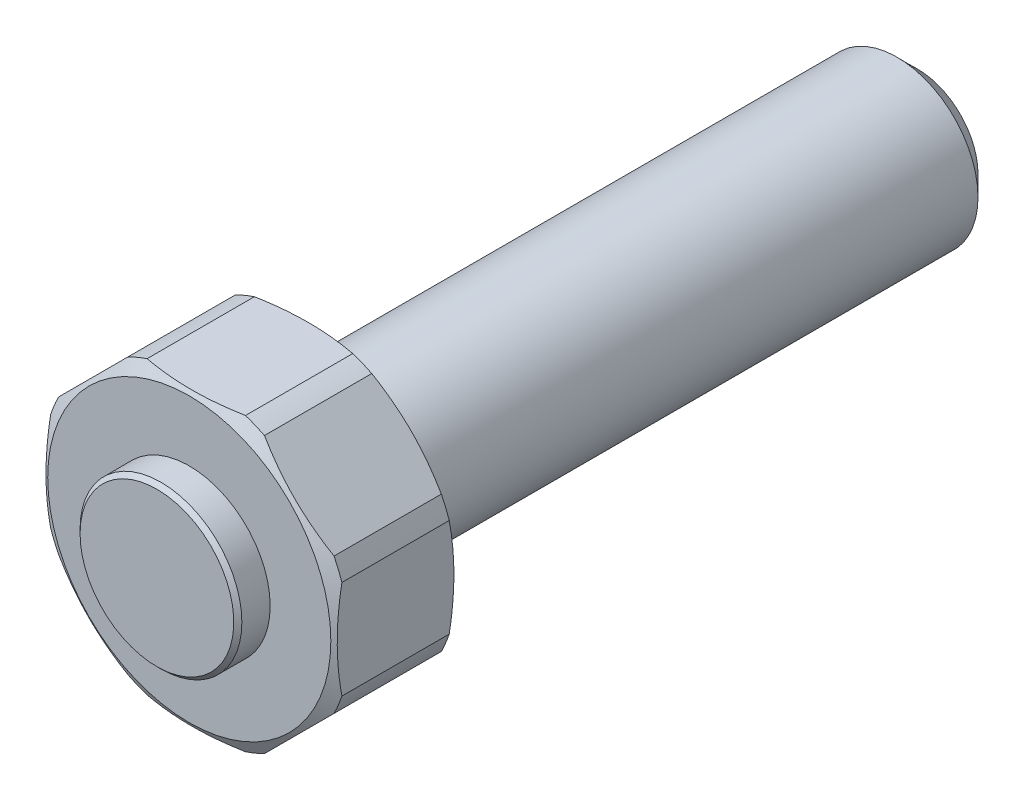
ISO-10303-21;
HEADER;
FILE_DESCRIPTION(('STEP AP214'),'2;1');
FILE_NAME('part.step','',(''),(''),'','','');
FILE_SCHEMA(('AUTOMOTIVE_DESIGN { 1 0 10303 214 1 1 1 1 }'));
ENDSEC;
DATA;
#1=APPLICATION_CONTEXT('core data for automotive mechanical design processes');
#2=APPLICATION_PROTOCOL_DEFINITION('international standard','automotive_design',2000,#1);
#3=PRODUCT_CONTEXT('',#1,'mechanical');
#4=PRODUCT('Part','Part','',(#3));
#5=PRODUCT_RELATED_PRODUCT_CATEGORY('part','',(#4));
#6=PRODUCT_DEFINITION_FORMATION('','',#4);
#7=PRODUCT_DEFINITION_CONTEXT('part definition',#1,'design');
#8=PRODUCT_DEFINITION('design','',#6,#7);
#9=PRODUCT_DEFINITION_SHAPE('','',#8);
#10=(LENGTH_UNIT() NAMED_UNIT(*) SI_UNIT(.MILLI.,.METRE.));
#11=(NAMED_UNIT(*) PLANE_ANGLE_UNIT() SI_UNIT($,.RADIAN.));
#12=(NAMED_UNIT(*) SI_UNIT($,.STERADIAN.) SOLID_ANGLE_UNIT());
#13=UNCERTAINTY_MEASURE_WITH_UNIT(LENGTH_MEASURE(1.E-05),#10,'distance_accuracy_value','');
#14=(GEOMETRIC_REPRESENTATION_CONTEXT(3) GLOBAL_UNCERTAINTY_ASSIGNED_CONTEXT((#13)) GLOBAL_UNIT_ASSIGNED_CONTEXT((#10,
#11,#12)) REPRESENTATION_CONTEXT('',''));
#15=CARTESIAN_POINT('',(0.,0.,0.));
#16=DIRECTION('',(0.,0.,1.));
#17=DIRECTION('',(1.,0.,0.));
#18=AXIS2_PLACEMENT_3D('',#15,#16,#17);
#19=CARTESIAN_POINT('',(10.,0.,0.));
#20=DIRECTION('',(0.,0.,1.));
#21=DIRECTION('',(1.,0.,0.));
#22=AXIS2_PLACEMENT_3D('',#19,#20,#21);
#23=PLANE('',#22);
#24=CARTESIAN_POINT('',(0.,0.,0.));
#25=DIRECTION('',(0.,0.,1.));
#26=DIRECTION('',(1.,0.,0.));
#27=AXIS2_PLACEMENT_3D('',#24,#25,#26);
#28=CIRCLE('',#27,10.);
#29=CARTESIAN_POINT('',(10.,0.,0.));
#30=VERTEX_POINT('',#29);
#31=EDGE_CURVE('E193',#30,#30,#28,.T.);
#32=ORIENTED_EDGE('',*,*,#31,.T.);
#33=EDGE_LOOP('',(#32));
#34=FACE_BOUND('',#33,.T.);
#35=CARTESIAN_POINT('',(0.,0.,0.));
#36=DIRECTION('',(0.,0.,-1.));
#37=DIRECTION('',(-1.,0.,0.));
#38=AXIS2_PLACEMENT_3D('',#35,#36,#37);
#39=CIRCLE('',#38,17.5);
#40=CARTESIAN_POINT('',(-17.5,0.,0.));
#41=VERTEX_POINT('',#40);
#42=EDGE_CURVE('E376',#41,#41,#39,.T.);
#43=ORIENTED_EDGE('',*,*,#42,.T.);
#44=EDGE_LOOP('',(#43));
#45=FACE_BOUND('',#44,.T.);
#46=ADVANCED_FACE('F14',(#34,#45),#23,.F.);
#47=CARTESIAN_POINT('',(0.,0.,-75.));
#48=DIRECTION('',(0.,0.,1.));
#49=DIRECTION('',(1.,0.,0.));
#50=AXIS2_PLACEMENT_3D('',#47,#48,#49);
#51=PLANE('',#50);
#52=CARTESIAN_POINT('',(0.,0.,-75.));
#53=DIRECTION('',(0.,0.,1.));
#54=DIRECTION('',(1.,0.,0.));
#55=AXIS2_PLACEMENT_3D('',#52,#53,#54);
#56=CIRCLE('',#55,7.5);
#57=CARTESIAN_POINT('',(7.5,0.,-75.));
#58=VERTEX_POINT('',#57);
#59=EDGE_CURVE('E205',#58,#58,#56,.F.);
#60=ORIENTED_EDGE('',*,*,#59,.T.);
#61=EDGE_LOOP('',(#60));
#62=FACE_BOUND('',#61,.T.);
#63=ADVANCED_FACE('F334',(#62),#51,.F.);
#64=CARTESIAN_POINT('',(0.,0.,5.));
#65=DIRECTION('',(0.,0.,1.));
#66=DIRECTION('',(1.,0.,0.));
#67=AXIS2_PLACEMENT_3D('',#64,#65,#66);
#68=CYLINDRICAL_SURFACE('',#67,10.);
#69=CARTESIAN_POINT('',(0.,0.,-72.5));
#70=DIRECTION('',(0.,0.,1.));
#71=DIRECTION('',(1.,0.,0.));
#72=AXIS2_PLACEMENT_3D('',#69,#70,#71);
#73=CIRCLE('',#72,10.);
#74=CARTESIAN_POINT('',(10.,0.,-72.5));
#75=VERTEX_POINT('',#74);
#76=EDGE_CURVE('E202',#75,#75,#73,.T.);
#77=ORIENTED_EDGE('',*,*,#76,.T.);
#78=EDGE_LOOP('',(#77));
#79=FACE_BOUND('',#78,.T.);
#80=ORIENTED_EDGE('',*,*,#31,.F.);
#81=EDGE_LOOP('',(#80));
#82=FACE_BOUND('',#81,.T.);
#83=ADVANCED_FACE('F327',(#79,#82),#68,.T.);
#84=CARTESIAN_POINT('',(0.,0.,-72.5));
#85=DIRECTION('',(0.,0.,1.));
#86=DIRECTION('',(1.,0.,0.));
#87=AXIS2_PLACEMENT_3D('',#84,#85,#86);
#88=CONICAL_SURFACE('',#87,10.,0.785398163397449);
#89=ORIENTED_EDGE('',*,*,#59,.F.);
#90=EDGE_LOOP('',(#89));
#91=FACE_BOUND('',#90,.T.);
#92=ORIENTED_EDGE('',*,*,#76,.F.);
#93=EDGE_LOOP('',(#92));
#94=FACE_BOUND('',#93,.T.);
#95=ADVANCED_FACE('F16',(#91,#94),#88,.T.);
#96=CARTESIAN_POINT('',(0.,0.,-75.));
#97=DIRECTION('',(0.,0.,-1.));
#98=DIRECTION('',(-1.,0.,0.));
#99=AXIS2_PLACEMENT_3D('',#96,#97,#98);
#100=CYLINDRICAL_SURFACE('',#99,19.);
#101=CARTESIAN_POINT('',(0.,0.,14.1339745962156));
#102=DIRECTION('',(0.,0.,-1.));
#103=DIRECTION('',(-1.,0.,0.));
#104=AXIS2_PLACEMENT_3D('',#101,#102,#103);
#105=CIRCLE('',#104,19.);
#106=CARTESIAN_POINT('',(6.08276253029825,-18.,14.1339745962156));
#107=VERTEX_POINT('',#106);
#108=CARTESIAN_POINT('',(8.42675942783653,-17.0290846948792,14.1339745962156));
#109=VERTEX_POINT('',#108);
#110=EDGE_CURVE('E488',#107,#109,#105,.F.);
#111=ORIENTED_EDGE('',*,*,#110,.F.);
#112=DIRECTION('',(0.,0.,-1.));
#113=VECTOR('',#112,1.);
#114=CARTESIAN_POINT('',(6.08276253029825,-18.,-75.));
#115=LINE('',#114,#113);
#116=CARTESIAN_POINT('',(6.08276253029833,-18.,0.866025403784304));
#117=VERTEX_POINT('',#116);
#118=EDGE_CURVE('E9',#107,#117,#115,.T.);
#119=ORIENTED_EDGE('',*,*,#118,.T.);
#120=CARTESIAN_POINT('',(0.,0.,0.866025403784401));
#121=DIRECTION('',(0.,0.,1.));
#122=DIRECTION('',(1.,0.,0.));
#123=AXIS2_PLACEMENT_3D('',#120,#121,#122);
#124=CIRCLE('',#123,19.);
#125=CARTESIAN_POINT('',(8.42675942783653,-17.0290846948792,0.866025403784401));
#126=VERTEX_POINT('',#125);
#127=EDGE_CURVE('E373',#126,#117,#124,.F.);
#128=ORIENTED_EDGE('',*,*,#127,.F.);
#129=DIRECTION('',(0.,0.,-1.));
#130=VECTOR('',#129,1.);
#131=CARTESIAN_POINT('',(8.42675942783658,-17.0290846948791,-75.));
#132=LINE('',#131,#130);
#133=EDGE_CURVE('E187',#109,#126,#132,.T.);
#134=ORIENTED_EDGE('',*,*,#133,.F.);
#135=EDGE_LOOP('',(#111,#119,#128,#134));
#136=FACE_BOUND('',#135,.T.);
#137=ADVANCED_FACE('F314',(#136),#100,.T.);
#138=CARTESIAN_POINT('',(18.,-6.08276253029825,0.866025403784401));
#139=VERTEX_POINT('',#138);
#140=CARTESIAN_POINT('',(17.0290846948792,-8.42675942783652,0.866025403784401));
#141=VERTEX_POINT('',#140);
#142=EDGE_CURVE('E29',#139,#141,#124,.F.);
#143=ORIENTED_EDGE('',*,*,#142,.F.);
#144=DIRECTION('',(0.,0.,-1.));
#145=VECTOR('',#144,1.);
#146=CARTESIAN_POINT('',(18.,-6.08276253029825,-75.));
#147=LINE('',#146,#145);
#148=CARTESIAN_POINT('',(18.,-6.08276253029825,14.1339745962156));
#149=VERTEX_POINT('',#148);
#150=EDGE_CURVE('E181',#149,#139,#147,.T.);
#151=ORIENTED_EDGE('',*,*,#150,.F.);
#152=CARTESIAN_POINT('',(17.0290846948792,-8.42675942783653,14.1339745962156));
#153=VERTEX_POINT('',#152);
#154=EDGE_CURVE('E482',#153,#149,#105,.F.);
#155=ORIENTED_EDGE('',*,*,#154,.F.);
#156=DIRECTION('',(0.,0.,-1.));
#157=VECTOR('',#156,1.);
#158=CARTESIAN_POINT('',(17.0290846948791,-8.42675942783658,-75.));
#159=LINE('',#158,#157);
#160=EDGE_CURVE('E184',#141,#153,#159,.F.);
#161=ORIENTED_EDGE('',*,*,#160,.F.);
#162=EDGE_LOOP('',(#143,#151,#155,#161));
#163=FACE_BOUND('',#162,.T.);
#164=ADVANCED_FACE('F317',(#163),#100,.T.);
#165=CARTESIAN_POINT('',(17.0290846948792,8.42675942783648,0.866025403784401));
#166=VERTEX_POINT('',#165);
#167=CARTESIAN_POINT('',(18.,6.08276253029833,0.866025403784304));
#168=VERTEX_POINT('',#167);
#169=EDGE_CURVE('E35',#166,#168,#124,.F.);
#170=ORIENTED_EDGE('',*,*,#169,.F.);
#171=DIRECTION('',(0.,0.,-1.));
#172=VECTOR('',#171,1.);
#173=CARTESIAN_POINT('',(17.0290846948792,8.42675942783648,-75.));
#174=LINE('',#173,#172);
#175=CARTESIAN_POINT('',(17.0290846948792,8.42675942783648,14.1339745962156));
#176=VERTEX_POINT('',#175);
#177=EDGE_CURVE('E175',#176,#166,#174,.T.);
#178=ORIENTED_EDGE('',*,*,#177,.F.);
#179=CARTESIAN_POINT('',(18.,6.08276253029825,14.1339745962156));
#180=VERTEX_POINT('',#179);
#181=EDGE_CURVE('E426',#180,#176,#105,.F.);
#182=ORIENTED_EDGE('',*,*,#181,.F.);
#183=DIRECTION('',(0.,0.,-1.));
#184=VECTOR('',#183,1.);
#185=CARTESIAN_POINT('',(18.,6.08276253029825,-75.));
#186=LINE('',#185,#184);
#187=EDGE_CURVE('E178',#168,#180,#186,.F.);
#188=ORIENTED_EDGE('',*,*,#187,.F.);
#189=EDGE_LOOP('',(#170,#178,#182,#188));
#190=FACE_BOUND('',#189,.T.);
#191=ADVANCED_FACE('F325',(#190),#100,.T.);
#192=CARTESIAN_POINT('',(6.08276253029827,18.,0.866025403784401));
#193=VERTEX_POINT('',#192);
#194=CARTESIAN_POINT('',(8.42675942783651,17.0290846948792,0.866025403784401));
#195=VERTEX_POINT('',#194);
#196=EDGE_CURVE('E447',#193,#195,#124,.F.);
#197=ORIENTED_EDGE('',*,*,#196,.F.);
#198=DIRECTION('',(0.,0.,-1.));
#199=VECTOR('',#198,1.);
#200=CARTESIAN_POINT('',(6.08276253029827,18.,-75.));
#201=LINE('',#200,#199);
#202=CARTESIAN_POINT('',(6.08276253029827,18.,14.1339745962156));
#203=VERTEX_POINT('',#202);
#204=EDGE_CURVE('E169',#203,#193,#201,.T.);
#205=ORIENTED_EDGE('',*,*,#204,.F.);
#206=CARTESIAN_POINT('',(8.42675942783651,17.0290846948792,14.1339745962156));
#207=VERTEX_POINT('',#206);
#208=EDGE_CURVE('E424',#207,#203,#105,.F.);
#209=ORIENTED_EDGE('',*,*,#208,.F.);
#210=DIRECTION('',(0.,0.,-1.));
#211=VECTOR('',#210,1.);
#212=CARTESIAN_POINT('',(8.42675942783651,17.0290846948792,-75.));
#213=LINE('',#212,#211);
#214=EDGE_CURVE('E172',#195,#207,#213,.F.);
#215=ORIENTED_EDGE('',*,*,#214,.F.);
#216=EDGE_LOOP('',(#197,#205,#209,#215));
#217=FACE_BOUND('',#216,.T.);
#218=ADVANCED_FACE('F431',(#217),#100,.T.);
#219=CARTESIAN_POINT('',(-8.42675942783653,17.0290846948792,0.866025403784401));
#220=VERTEX_POINT('',#219);
#221=CARTESIAN_POINT('',(-6.08276253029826,18.,0.866025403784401));
#222=VERTEX_POINT('',#221);
#223=EDGE_CURVE('E444',#220,#222,#124,.F.);
#224=ORIENTED_EDGE('',*,*,#223,.F.);
#225=DIRECTION('',(0.,0.,-1.));
#226=VECTOR('',#225,1.);
#227=CARTESIAN_POINT('',(-8.42675942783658,17.0290846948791,-75.));
#228=LINE('',#227,#226);
#229=CARTESIAN_POINT('',(-8.42675942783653,17.0290846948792,14.1339745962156));
#230=VERTEX_POINT('',#229);
#231=EDGE_CURVE('E158',#230,#220,#228,.T.);
#232=ORIENTED_EDGE('',*,*,#231,.F.);
#233=CARTESIAN_POINT('',(-6.08276253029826,18.,14.1339745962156));
#234=VERTEX_POINT('',#233);
#235=EDGE_CURVE('E372',#234,#230,#105,.F.);
#236=ORIENTED_EDGE('',*,*,#235,.F.);
#237=DIRECTION('',(0.,0.,-1.));
#238=VECTOR('',#237,1.);
#239=CARTESIAN_POINT('',(-6.08276253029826,18.,-75.));
#240=LINE('',#239,#238);
#241=EDGE_CURVE('E166',#222,#234,#240,.F.);
#242=ORIENTED_EDGE('',*,*,#241,.F.);
#243=EDGE_LOOP('',(#224,#232,#236,#242));
#244=FACE_BOUND('',#243,.T.);
#245=ADVANCED_FACE('F453',(#244),#100,.T.);
#246=DIRECTION('',(0.,0.,-1.));
#247=VECTOR('',#246,1.);
#248=CARTESIAN_POINT('',(-18.,-6.08276253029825,-75.));
#249=LINE('',#248,#247);
#250=CARTESIAN_POINT('',(-18.,-6.08276253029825,14.1339745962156));
#251=VERTEX_POINT('',#250);
#252=CARTESIAN_POINT('',(-18.,-6.08276253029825,0.866025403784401));
#253=VERTEX_POINT('',#252);
#254=EDGE_CURVE('E145',#251,#253,#249,.T.);
#255=ORIENTED_EDGE('',*,*,#254,.T.);
#256=CARTESIAN_POINT('',(-17.0290846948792,-8.4267594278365,0.866025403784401));
#257=VERTEX_POINT('',#256);
#258=EDGE_CURVE('E440',#257,#253,#124,.F.);
#259=ORIENTED_EDGE('',*,*,#258,.F.);
#260=DIRECTION('',(0.,0.,-1.));
#261=VECTOR('',#260,1.);
#262=CARTESIAN_POINT('',(-17.0290846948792,-8.4267594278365,-75.));
#263=LINE('',#262,#261);
#264=CARTESIAN_POINT('',(-17.0290846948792,-8.4267594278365,14.1339745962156));
#265=VERTEX_POINT('',#264);
#266=EDGE_CURVE('E148',#257,#265,#263,.F.);
#267=ORIENTED_EDGE('',*,*,#266,.T.);
#268=EDGE_CURVE('E131',#251,#265,#105,.F.);
#269=ORIENTED_EDGE('',*,*,#268,.F.);
#270=EDGE_LOOP('',(#255,#259,#267,#269));
#271=FACE_BOUND('',#270,.T.);
#272=ADVANCED_FACE('F143',(#271),#100,.T.);
#273=CARTESIAN_POINT('',(-18.,6.08276253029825,0.866025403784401));
#274=VERTEX_POINT('',#273);
#275=CARTESIAN_POINT('',(-17.0290846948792,8.42675942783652,0.866025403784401));
#276=VERTEX_POINT('',#275);
#277=EDGE_CURVE('E443',#274,#276,#124,.F.);
#278=ORIENTED_EDGE('',*,*,#277,.F.);
#279=DIRECTION('',(0.,0.,-1.));
#280=VECTOR('',#279,1.);
#281=CARTESIAN_POINT('',(-18.,6.08276253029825,-75.));
#282=LINE('',#281,#280);
#283=CARTESIAN_POINT('',(-18.,6.08276253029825,14.1339745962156));
#284=VERTEX_POINT('',#283);
#285=EDGE_CURVE('E155',#274,#284,#282,.F.);
#286=ORIENTED_EDGE('',*,*,#285,.T.);
#287=CARTESIAN_POINT('',(-17.0290846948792,8.42675942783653,14.1339745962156));
#288=VERTEX_POINT('',#287);
#289=EDGE_CURVE('E134',#288,#284,#105,.F.);
#290=ORIENTED_EDGE('',*,*,#289,.F.);
#291=DIRECTION('',(0.,0.,-1.));
#292=VECTOR('',#291,1.);
#293=CARTESIAN_POINT('',(-17.0290846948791,8.42675942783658,-75.));
#294=LINE('',#293,#292);
#295=EDGE_CURVE('E154',#276,#288,#294,.F.);
#296=ORIENTED_EDGE('',*,*,#295,.F.);
#297=EDGE_LOOP('',(#278,#286,#290,#296));
#298=FACE_BOUND('',#297,.T.);
#299=ADVANCED_FACE('F331',(#298),#100,.T.);
#300=DIRECTION('',(0.,0.,-1.));
#301=VECTOR('',#300,1.);
#302=CARTESIAN_POINT('',(-8.42675942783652,-17.0290846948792,-75.));
#303=LINE('',#302,#301);
#304=CARTESIAN_POINT('',(-8.42675942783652,-17.0290846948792,14.1339745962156));
#305=VERTEX_POINT('',#304);
#306=CARTESIAN_POINT('',(-8.42675942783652,-17.0290846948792,0.866025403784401));
#307=VERTEX_POINT('',#306);
#308=EDGE_CURVE('E160',#305,#307,#303,.T.);
#309=ORIENTED_EDGE('',*,*,#308,.T.);
#310=CARTESIAN_POINT('',(-6.08276253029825,-18.,0.866025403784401));
#311=VERTEX_POINT('',#310);
#312=EDGE_CURVE('E442',#311,#307,#124,.F.);
#313=ORIENTED_EDGE('',*,*,#312,.F.);
#314=DIRECTION('',(0.,0.,-1.));
#315=VECTOR('',#314,1.);
#316=CARTESIAN_POINT('',(-6.08276253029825,-18.,-75.));
#317=LINE('',#316,#315);
#318=CARTESIAN_POINT('',(-6.08276253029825,-18.,14.1339745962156));
#319=VERTEX_POINT('',#318);
#320=EDGE_CURVE('E22',#311,#319,#317,.F.);
#321=ORIENTED_EDGE('',*,*,#320,.T.);
#322=EDGE_CURVE('E150',#305,#319,#105,.F.);
#323=ORIENTED_EDGE('',*,*,#322,.F.);
#324=EDGE_LOOP('',(#309,#313,#321,#323));
#325=FACE_BOUND('',#324,.T.);
#326=ADVANCED_FACE('F224',(#325),#100,.T.);
#327=CARTESIAN_POINT('',(0.,0.,4.3829630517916));
#328=DIRECTION('',(0.,0.,1.));
#329=DIRECTION('',(1.,0.,0.));
#330=AXIS2_PLACEMENT_3D('',#327,#328,#329);
#331=CONICAL_SURFACE('',#330,25.0915146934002,1.0471975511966);
#332=CARTESIAN_POINT('',(17.0298497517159,-8.4259943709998,0.866225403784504));
#333=CARTESIAN_POINT('',(16.7279790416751,-8.72786508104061,0.787270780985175));
#334=CARTESIAN_POINT('',(16.4251282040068,-9.0307159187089,0.715579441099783));
#335=CARTESIAN_POINT('',(15.8177220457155,-9.63812207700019,0.587832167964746));
#336=CARTESIAN_POINT('',(15.5131663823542,-9.9426777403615,0.531779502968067));
#337=CARTESIAN_POINT('',(14.9026569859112,-10.5531871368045,0.436440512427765));
#338=CARTESIAN_POINT('',(14.5967029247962,-10.8591411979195,0.397158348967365));
#339=CARTESIAN_POINT('',(13.9839392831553,-11.4719048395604,0.336202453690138));
#340=CARTESIAN_POINT('',(13.6771297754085,-11.7787143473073,0.314527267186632));
#341=CARTESIAN_POINT('',(13.0674827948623,-12.3883613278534,0.28944273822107));
#342=CARTESIAN_POINT('',(12.7646505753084,-12.6911935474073,0.285779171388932));
#343=CARTESIAN_POINT('',(12.1591220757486,-13.2967220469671,0.296110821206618));
#344=CARTESIAN_POINT('',(11.8564258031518,-13.5994183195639,0.310106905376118));
#345=CARTESIAN_POINT('',(11.2518585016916,-14.2039856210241,0.35543953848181));
#346=CARTESIAN_POINT('',(10.9499871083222,-14.5058570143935,0.386766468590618));
#347=CARTESIAN_POINT('',(10.3473726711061,-15.1084714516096,0.466094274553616));
#348=CARTESIAN_POINT('',(10.0466295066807,-15.409214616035,0.514093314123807));
#349=CARTESIAN_POINT('',(9.63629143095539,-15.8195526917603,0.590500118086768));
#350=CARTESIAN_POINT('',(9.52604440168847,-15.9297997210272,0.61211117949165));
#351=CARTESIAN_POINT('',(9.30577444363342,-16.1500696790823,0.65740306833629));
#352=CARTESIAN_POINT('',(9.19575149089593,-16.2600926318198,0.681083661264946));
#353=CARTESIAN_POINT('',(8.97563723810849,-16.4802068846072,0.730526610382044));
#354=CARTESIAN_POINT('',(8.86554654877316,-16.5902975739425,0.756294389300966));
#355=CARTESIAN_POINT('',(8.64559368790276,-16.810250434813,0.809798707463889));
#356=CARTESIAN_POINT('',(8.53573153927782,-16.9201125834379,0.837535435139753));
#357=CARTESIAN_POINT('',(8.42599437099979,-17.0298497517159,0.866225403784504));
#358=B_SPLINE_CURVE_WITH_KNOTS('',3,(#332,#333,#334,#335,#336,#337,#338,#339,#340,#341,#342,
#343,#344,#345,#346,#347,#348,#349,#350,#351,#352,#353,#354,#355,#356,#357),.UNSPECIFIED.,.F.,
.F.,(4,2,2,2,2,2,2,2,2,2,2,2,4),(0.,1.3024481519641,2.60516829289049,3.90821155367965,
5.21114714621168,6.495638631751,7.78019321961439,9.06403557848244,10.3477365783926,
10.8199379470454,11.2920858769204,11.7655024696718,12.2389644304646),.UNSPECIFIED.);
#359=EDGE_CURVE('E276',#141,#126,#358,.T.);
#360=ORIENTED_EDGE('',*,*,#359,.T.);
#361=ORIENTED_EDGE('',*,*,#127,.T.);
#362=CARTESIAN_POINT('',(-22.5178938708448,-18.,6.54024348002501));
#363=CARTESIAN_POINT('',(-22.1759841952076,-18.,6.38605473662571));
#364=CARTESIAN_POINT('',(-21.8335648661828,-18.,6.23299701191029));
#365=CARTESIAN_POINT('',(-21.147610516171,-18.,5.929386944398));
#366=CARTESIAN_POINT('',(-20.804075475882,-18.,5.77883464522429));
#367=CARTESIAN_POINT('',(-19.771514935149,-18.,5.33124166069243));
#368=CARTESIAN_POINT('',(-19.0806880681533,-18.,5.0383346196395));
#369=CARTESIAN_POINT('',(-17.689331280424,-18.,4.46430506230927));
#370=CARTESIAN_POINT('',(-16.9887680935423,-18.,4.18326293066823));
#371=CARTESIAN_POINT('',(-15.5811351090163,-18.,3.6380261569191));
#372=CARTESIAN_POINT('',(-14.8740657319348,-18.,3.37383043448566));
#373=CARTESIAN_POINT('',(-13.4597077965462,-18.,2.86887983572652));
#374=CARTESIAN_POINT('',(-12.7524953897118,-18.,2.62791291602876));
#375=CARTESIAN_POINT('',(-11.3298390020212,-18.,2.17121904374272));
#376=CARTESIAN_POINT('',(-10.6143944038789,-18.,1.95549399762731));
#377=CARTESIAN_POINT('',(-9.17638376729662,-18.,1.55555806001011));
#378=CARTESIAN_POINT('',(-8.45383703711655,-18.,1.37127835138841));
#379=CARTESIAN_POINT('',(-7.00021814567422,-18.,1.04024366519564));
#380=CARTESIAN_POINT('',(-6.26914812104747,-18.,0.893479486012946));
#381=CARTESIAN_POINT('',(-5.1131533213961,-18.,0.69732825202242));
#382=CARTESIAN_POINT('',(-4.69071968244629,-18.,0.633113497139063));
#383=CARTESIAN_POINT('',(-3.84378122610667,-18.,0.520320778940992));
#384=CARTESIAN_POINT('',(-3.4192765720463,-18.,0.471741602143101));
#385=CARTESIAN_POINT('',(-2.56862221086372,-18.,0.391159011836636));
#386=CARTESIAN_POINT('',(-2.14247225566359,-18.,0.359158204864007));
#387=CARTESIAN_POINT('',(-1.28921701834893,-18.,0.312411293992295));
#388=CARTESIAN_POINT('',(-0.862111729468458,-18.,0.297665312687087));
#389=CARTESIAN_POINT('',(-0.00731534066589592,-18.,0.285745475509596));
#390=CARTESIAN_POINT('',(0.420375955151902,-18.,0.288585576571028));
#391=CARTESIAN_POINT('',(1.27527492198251,-18.,0.31180769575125));
#392=CARTESIAN_POINT('',(1.70248259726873,-18.,0.332189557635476));
#393=CARTESIAN_POINT('',(2.55559457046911,-18.,0.390045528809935));
#394=CARTESIAN_POINT('',(2.98149924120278,-18.,0.427514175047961));
#395=CARTESIAN_POINT('',(3.83158411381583,-18.,0.518776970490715));
#396=CARTESIAN_POINT('',(4.25576414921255,-18.,0.572572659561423));
#397=CARTESIAN_POINT('',(5.12133703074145,-18.,0.69829377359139));
#398=CARTESIAN_POINT('',(5.56262502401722,-18.,0.770938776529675));
#399=CARTESIAN_POINT('',(6.44240459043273,-18.,0.931622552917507));
#400=CARTESIAN_POINT('',(6.88089589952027,-18.,1.01966275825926));
#401=CARTESIAN_POINT('',(8.19209260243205,-18.,1.30476536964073));
#402=CARTESIAN_POINT('',(9.06027800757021,-18.,1.52277299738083));
#403=CARTESIAN_POINT('',(10.7873206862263,-18.,2.00410024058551));
#404=CARTESIAN_POINT('',(11.6461291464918,-18.,2.26759116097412));
#405=CARTESIAN_POINT('',(13.3520578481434,-18.,2.82936087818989));
#406=CARTESIAN_POINT('',(14.1991796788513,-18.,3.12763489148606));
#407=CARTESIAN_POINT('',(15.8938848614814,-18.,3.75503290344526));
#408=CARTESIAN_POINT('',(16.7413416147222,-18.,4.08449592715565));
#409=CARTESIAN_POINT('',(18.4276496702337,-18.,4.76484429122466));
#410=CARTESIAN_POINT('',(19.2665002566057,-18.,5.1157313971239));
#411=CARTESIAN_POINT('',(20.5153017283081,-18.,5.65287018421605));
#412=CARTESIAN_POINT('',(20.927988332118,-18.,5.83280917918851));
#413=CARTESIAN_POINT('',(21.7517491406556,-18.,6.19634968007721));
#414=CARTESIAN_POINT('',(22.1628233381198,-18.,6.3799512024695));
#415=CARTESIAN_POINT('',(22.98337613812,-18.,6.75035241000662));
#416=CARTESIAN_POINT('',(23.3928551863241,-18.,6.93715110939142));
#417=CARTESIAN_POINT('',(24.2104631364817,-18.,7.31366019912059));
#418=CARTESIAN_POINT('',(24.6185920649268,-18.,7.50337053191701));
#419=CARTESIAN_POINT('',(25.0261141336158,-18.,7.69437007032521));
#420=B_SPLINE_CURVE_WITH_KNOTS('',3,(#362,#363,#364,#365,#366,#367,#368,#369,#370,#371,#372,
#373,#374,#375,#376,#377,#378,#379,#380,#381,#382,#383,#384,#385,#386,#387,#388,#389,#390,#391,
#392,#393,#394,#395,#396,#397,#398,#399,#400,#401,#402,#403,#404,#405,#406,#407,#408,#409,#410,
#411,#412,#413,#414,#415,#416,#417,#418,#419),.UNSPECIFIED.,.F.,.F.,(4,2,2,2,2,2,2,2,2,2,2,2,2,
2,2,2,2,2,2,2,2,2,2,2,2,2,2,2,4),(0.,1.12520172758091,2.25042302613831,4.50137287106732,
6.76570069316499,9.02988316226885,11.2709165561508,13.5121191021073,15.7483521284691,
17.9840361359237,19.2656462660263,20.54715690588,21.8288689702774,23.1105901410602,
24.393328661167,25.6760557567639,26.9583730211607,28.2408112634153,29.5821873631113,
30.9236882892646,33.6074252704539,36.3014998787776,38.9952044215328,41.7225809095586,
44.4501824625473,45.8007968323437,47.1514172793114,48.5016285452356,49.8518131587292),.UNSPECIFIED.);
#421=EDGE_CURVE('E208',#311,#117,#420,.T.);
#422=ORIENTED_EDGE('',*,*,#421,.F.);
#423=ORIENTED_EDGE('',*,*,#312,.T.);
#424=CARTESIAN_POINT('',(-17.0298497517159,-8.42599437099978,0.866225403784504));
#425=CARTESIAN_POINT('',(-16.7279790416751,-8.7278650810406,0.787270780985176));
#426=CARTESIAN_POINT('',(-16.4251282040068,-9.03071591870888,0.715579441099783));
#427=CARTESIAN_POINT('',(-15.8177220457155,-9.63812207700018,0.587832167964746));
#428=CARTESIAN_POINT('',(-15.5131663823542,-9.94267774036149,0.531779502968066));
#429=CARTESIAN_POINT('',(-14.9026569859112,-10.5531871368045,0.436440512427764));
#430=CARTESIAN_POINT('',(-14.5967029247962,-10.8591411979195,0.397158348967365));
#431=CARTESIAN_POINT('',(-13.9839392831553,-11.4719048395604,0.336202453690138));
#432=CARTESIAN_POINT('',(-13.6771297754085,-11.7787143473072,0.314527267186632));
#433=CARTESIAN_POINT('',(-13.0674827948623,-12.3883613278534,0.289442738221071));
#434=CARTESIAN_POINT('',(-12.7646505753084,-12.6911935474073,0.285779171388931));
#435=CARTESIAN_POINT('',(-12.1591220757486,-13.2967220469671,0.296110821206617));
#436=CARTESIAN_POINT('',(-11.8564258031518,-13.5994183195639,0.310106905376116));
#437=CARTESIAN_POINT('',(-11.2518585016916,-14.2039856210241,0.355439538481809));
#438=CARTESIAN_POINT('',(-10.9499871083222,-14.5058570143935,0.386766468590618));
#439=CARTESIAN_POINT('',(-10.3473726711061,-15.1084714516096,0.466094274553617));
#440=CARTESIAN_POINT('',(-10.0466295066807,-15.409214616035,0.514093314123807));
#441=CARTESIAN_POINT('',(-9.63629143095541,-15.8195526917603,0.590500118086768));
#442=CARTESIAN_POINT('',(-9.52604440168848,-15.9297997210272,0.612111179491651));
#443=CARTESIAN_POINT('',(-9.30577444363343,-16.1500696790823,0.657403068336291));
#444=CARTESIAN_POINT('',(-9.19575149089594,-16.2600926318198,0.681083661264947));
#445=CARTESIAN_POINT('',(-8.9756372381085,-16.4802068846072,0.730526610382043));
#446=CARTESIAN_POINT('',(-8.86554654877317,-16.5902975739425,0.756294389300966));
#447=CARTESIAN_POINT('',(-8.64559368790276,-16.810250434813,0.809798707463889));
#448=CARTESIAN_POINT('',(-8.53573153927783,-16.9201125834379,0.837535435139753));
#449=CARTESIAN_POINT('',(-8.42599437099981,-17.0298497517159,0.866225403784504));
#450=B_SPLINE_CURVE_WITH_KNOTS('',3,(#424,#425,#426,#427,#428,#429,#430,#431,#432,#433,#434,
#435,#436,#437,#438,#439,#440,#441,#442,#443,#444,#445,#446,#447,#448,#449),.UNSPECIFIED.,.F.,
.F.,(4,2,2,2,2,2,2,2,2,2,2,2,4),(0.,1.3024481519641,2.60516829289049,3.90821155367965,
5.21114714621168,6.495638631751,7.78019321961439,9.06403557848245,10.3477365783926,
10.8199379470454,11.2920858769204,11.7655024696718,12.2389644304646),.UNSPECIFIED.);
#451=EDGE_CURVE('E233',#257,#307,#450,.T.);
#452=ORIENTED_EDGE('',*,*,#451,.F.);
#453=ORIENTED_EDGE('',*,*,#258,.T.);
#454=CARTESIAN_POINT('',(-18.,-22.5178938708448,6.54024348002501));
#455=CARTESIAN_POINT('',(-18.,-22.1759841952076,6.3860547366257));
#456=CARTESIAN_POINT('',(-18.,-21.8335648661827,6.23299701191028));
#457=CARTESIAN_POINT('',(-18.,-21.1476105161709,5.92938694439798));
#458=CARTESIAN_POINT('',(-18.,-20.804075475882,5.77883464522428));
#459=CARTESIAN_POINT('',(-18.,-19.7715149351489,5.33124166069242));
#460=CARTESIAN_POINT('',(-18.,-19.0806880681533,5.03833461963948));
#461=CARTESIAN_POINT('',(-18.,-17.689331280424,4.46430506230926));
#462=CARTESIAN_POINT('',(-18.,-16.9887680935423,4.18326293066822));
#463=CARTESIAN_POINT('',(-18.,-15.5811351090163,3.63802615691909));
#464=CARTESIAN_POINT('',(-18.,-14.8740657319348,3.37383043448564));
#465=CARTESIAN_POINT('',(-18.,-13.4597077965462,2.86887983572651));
#466=CARTESIAN_POINT('',(-18.,-12.7524953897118,2.62791291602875));
#467=CARTESIAN_POINT('',(-18.,-11.3298390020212,2.17121904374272));
#468=CARTESIAN_POINT('',(-18.,-10.6143944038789,1.95549399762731));
#469=CARTESIAN_POINT('',(-18.,-9.17638376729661,1.55555806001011));
#470=CARTESIAN_POINT('',(-18.,-8.45383703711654,1.37127835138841));
#471=CARTESIAN_POINT('',(-18.,-7.00021814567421,1.04024366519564));
#472=CARTESIAN_POINT('',(-18.,-6.26914812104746,0.893479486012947));
#473=CARTESIAN_POINT('',(-18.,-5.11315332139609,0.697328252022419));
#474=CARTESIAN_POINT('',(-18.,-4.69071968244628,0.633113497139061));
#475=CARTESIAN_POINT('',(-18.,-3.84378122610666,0.52032077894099));
#476=CARTESIAN_POINT('',(-18.,-3.41927657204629,0.471741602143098));
#477=CARTESIAN_POINT('',(-18.,-2.56862221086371,0.391159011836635));
#478=CARTESIAN_POINT('',(-18.,-2.14247225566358,0.359158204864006));
#479=CARTESIAN_POINT('',(-18.,-1.28921701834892,0.312411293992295));
#480=CARTESIAN_POINT('',(-18.,-0.862111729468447,0.297665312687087));
#481=CARTESIAN_POINT('',(-18.,-0.00731534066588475,0.285745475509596));
#482=CARTESIAN_POINT('',(-18.,0.420375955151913,0.288585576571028));
#483=CARTESIAN_POINT('',(-18.,1.27527492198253,0.311807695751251));
#484=CARTESIAN_POINT('',(-18.,1.70248259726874,0.332189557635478));
#485=CARTESIAN_POINT('',(-18.,2.55559457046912,0.390045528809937));
#486=CARTESIAN_POINT('',(-18.,2.98149924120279,0.427514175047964));
#487=CARTESIAN_POINT('',(-18.,3.83158411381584,0.518776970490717));
#488=CARTESIAN_POINT('',(-18.,4.25576414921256,0.572572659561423));
#489=CARTESIAN_POINT('',(-18.,5.12133703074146,0.69829377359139));
#490=CARTESIAN_POINT('',(-18.,5.56262502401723,0.770938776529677));
#491=CARTESIAN_POINT('',(-18.,6.44240459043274,0.931622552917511));
#492=CARTESIAN_POINT('',(-18.,6.88089589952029,1.01966275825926));
#493=CARTESIAN_POINT('',(-18.,8.19209260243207,1.30476536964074));
#494=CARTESIAN_POINT('',(-18.,9.06027800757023,1.52277299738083));
#495=CARTESIAN_POINT('',(-18.,10.7873206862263,2.00410024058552));
#496=CARTESIAN_POINT('',(-18.,11.6461291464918,2.26759116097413));
#497=CARTESIAN_POINT('',(-18.,13.3520578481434,2.8293608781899));
#498=CARTESIAN_POINT('',(-18.,14.1991796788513,3.12763489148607));
#499=CARTESIAN_POINT('',(-18.,15.8938848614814,3.75503290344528));
#500=CARTESIAN_POINT('',(-18.,16.7413416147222,4.08449592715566));
#501=CARTESIAN_POINT('',(-18.,18.4276496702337,4.76484429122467));
#502=CARTESIAN_POINT('',(-18.,19.2665002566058,5.11573139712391));
#503=CARTESIAN_POINT('',(-18.,20.5153017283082,5.65287018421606));
#504=CARTESIAN_POINT('',(-18.,20.927988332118,5.83280917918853));
#505=CARTESIAN_POINT('',(-18.,21.7517491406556,6.19634968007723));
#506=CARTESIAN_POINT('',(-18.,22.1628233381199,6.37995120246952));
#507=CARTESIAN_POINT('',(-18.,22.9833761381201,6.75035241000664));
#508=CARTESIAN_POINT('',(-18.,23.3928551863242,6.93715110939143));
#509=CARTESIAN_POINT('',(-18.,24.2104631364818,7.31366019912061));
#510=CARTESIAN_POINT('',(-18.,24.6185920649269,7.50337053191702));
#511=CARTESIAN_POINT('',(-18.,25.0261141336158,7.69437007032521));
#512=B_SPLINE_CURVE_WITH_KNOTS('',3,(#454,#455,#456,#457,#458,#459,#460,#461,#462,#463,#464,
#465,#466,#467,#468,#469,#470,#471,#472,#473,#474,#475,#476,#477,#478,#479,#480,#481,#482,#483,
#484,#485,#486,#487,#488,#489,#490,#491,#492,#493,#494,#495,#496,#497,#498,#499,#500,#501,#502,
#503,#504,#505,#506,#507,#508,#509,#510,#511),.UNSPECIFIED.,.F.,.F.,(4,2,2,2,2,2,2,2,2,2,2,2,2,
2,2,2,2,2,2,2,2,2,2,2,2,2,2,2,4),(0.,1.12520172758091,2.25042302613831,4.50137287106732,
6.76570069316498,9.02988316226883,11.2709165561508,13.5121191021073,15.7483521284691,
17.9840361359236,19.2656462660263,20.5471569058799,21.8288689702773,23.1105901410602,
24.3933286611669,25.6760557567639,26.9583730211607,28.2408112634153,29.5821873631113,
30.9236882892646,33.6074252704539,36.3014998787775,38.9952044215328,41.7225809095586,
44.4501824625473,45.8007968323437,47.1514172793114,48.5016285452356,49.8518131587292),.UNSPECIFIED.);
#513=EDGE_CURVE('E153',#274,#253,#512,.F.);
#514=ORIENTED_EDGE('',*,*,#513,.F.);
#515=ORIENTED_EDGE('',*,*,#277,.T.);
#516=CARTESIAN_POINT('',(-17.0298497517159,8.4259943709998,0.866225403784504));
#517=CARTESIAN_POINT('',(-16.7279790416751,8.72786508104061,0.787270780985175));
#518=CARTESIAN_POINT('',(-16.4251282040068,9.0307159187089,0.715579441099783));
#519=CARTESIAN_POINT('',(-15.8177220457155,9.63812207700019,0.587832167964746));
#520=CARTESIAN_POINT('',(-15.5131663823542,9.9426777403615,0.531779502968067));
#521=CARTESIAN_POINT('',(-14.9026569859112,10.5531871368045,0.436440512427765));
#522=CARTESIAN_POINT('',(-14.5967029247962,10.8591411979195,0.397158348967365));
#523=CARTESIAN_POINT('',(-13.9839392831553,11.4719048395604,0.336202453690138));
#524=CARTESIAN_POINT('',(-13.6771297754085,11.7787143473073,0.314527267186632));
#525=CARTESIAN_POINT('',(-13.0674827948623,12.3883613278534,0.28944273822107));
#526=CARTESIAN_POINT('',(-12.7646505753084,12.6911935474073,0.285779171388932));
#527=CARTESIAN_POINT('',(-12.1591220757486,13.2967220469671,0.296110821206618));
#528=CARTESIAN_POINT('',(-11.8564258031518,13.5994183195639,0.310106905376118));
#529=CARTESIAN_POINT('',(-11.2518585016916,14.2039856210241,0.35543953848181));
#530=CARTESIAN_POINT('',(-10.9499871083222,14.5058570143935,0.386766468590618));
#531=CARTESIAN_POINT('',(-10.3473726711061,15.1084714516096,0.466094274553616));
#532=CARTESIAN_POINT('',(-10.0466295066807,15.409214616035,0.514093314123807));
#533=CARTESIAN_POINT('',(-9.63629143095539,15.8195526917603,0.590500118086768));
#534=CARTESIAN_POINT('',(-9.52604440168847,15.9297997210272,0.61211117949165));
#535=CARTESIAN_POINT('',(-9.30577444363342,16.1500696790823,0.65740306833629));
#536=CARTESIAN_POINT('',(-9.19575149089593,16.2600926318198,0.681083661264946));
#537=CARTESIAN_POINT('',(-8.97563723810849,16.4802068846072,0.730526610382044));
#538=CARTESIAN_POINT('',(-8.86554654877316,16.5902975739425,0.756294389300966));
#539=CARTESIAN_POINT('',(-8.64559368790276,16.810250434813,0.809798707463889));
#540=CARTESIAN_POINT('',(-8.53573153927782,16.9201125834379,0.837535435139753));
#541=CARTESIAN_POINT('',(-8.42599437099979,17.0298497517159,0.866225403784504));
#542=B_SPLINE_CURVE_WITH_KNOTS('',3,(#516,#517,#518,#519,#520,#521,#522,#523,#524,#525,#526,
#527,#528,#529,#530,#531,#532,#533,#534,#535,#536,#537,#538,#539,#540,#541),.UNSPECIFIED.,.F.,
.F.,(4,2,2,2,2,2,2,2,2,2,2,2,4),(0.,1.3024481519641,2.60516829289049,3.90821155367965,
5.21114714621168,6.495638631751,7.78019321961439,9.06403557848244,10.3477365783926,
10.8199379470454,11.2920858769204,11.7655024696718,12.2389644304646),.UNSPECIFIED.);
#543=EDGE_CURVE('E248',#276,#220,#542,.T.);
#544=ORIENTED_EDGE('',*,*,#543,.T.);
#545=ORIENTED_EDGE('',*,*,#223,.T.);
#546=CARTESIAN_POINT('',(-22.5178938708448,18.,6.54024348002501));
#547=CARTESIAN_POINT('',(-22.1759841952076,18.,6.38605473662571));
#548=CARTESIAN_POINT('',(-21.8335648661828,18.,6.23299701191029));
#549=CARTESIAN_POINT('',(-21.147610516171,18.,5.929386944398));
#550=CARTESIAN_POINT('',(-20.804075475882,18.,5.7788346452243));
#551=CARTESIAN_POINT('',(-19.771514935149,18.,5.33124166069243));
#552=CARTESIAN_POINT('',(-19.0806880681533,18.,5.0383346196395));
#553=CARTESIAN_POINT('',(-17.689331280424,18.,4.46430506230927));
#554=CARTESIAN_POINT('',(-16.9887680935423,18.,4.18326293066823));
#555=CARTESIAN_POINT('',(-15.5811351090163,18.,3.6380261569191));
#556=CARTESIAN_POINT('',(-14.8740657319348,18.,3.37383043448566));
#557=CARTESIAN_POINT('',(-13.4597077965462,18.,2.86887983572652));
#558=CARTESIAN_POINT('',(-12.7524953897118,18.,2.62791291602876));
#559=CARTESIAN_POINT('',(-11.3298390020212,18.,2.17121904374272));
#560=CARTESIAN_POINT('',(-10.6143944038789,18.,1.95549399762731));
#561=CARTESIAN_POINT('',(-9.17638376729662,18.,1.55555806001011));
#562=CARTESIAN_POINT('',(-8.45383703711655,18.,1.37127835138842));
#563=CARTESIAN_POINT('',(-7.00021814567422,18.,1.04024366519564));
#564=CARTESIAN_POINT('',(-6.26914812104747,18.,0.893479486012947));
#565=CARTESIAN_POINT('',(-5.1131533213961,18.,0.69732825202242));
#566=CARTESIAN_POINT('',(-4.69071968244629,18.,0.633113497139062));
#567=CARTESIAN_POINT('',(-3.84378122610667,18.,0.520320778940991));
#568=CARTESIAN_POINT('',(-3.4192765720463,18.,0.4717416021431));
#569=CARTESIAN_POINT('',(-2.56862221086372,18.,0.391159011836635));
#570=CARTESIAN_POINT('',(-2.14247225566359,18.,0.359158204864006));
#571=CARTESIAN_POINT('',(-1.28921701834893,18.,0.312411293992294));
#572=CARTESIAN_POINT('',(-0.862111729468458,18.,0.297665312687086));
#573=CARTESIAN_POINT('',(-0.00731534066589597,18.,0.285745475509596));
#574=CARTESIAN_POINT('',(0.420375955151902,18.,0.288585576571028));
#575=CARTESIAN_POINT('',(1.27527492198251,18.,0.311807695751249));
#576=CARTESIAN_POINT('',(1.70248259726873,18.,0.332189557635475));
#577=CARTESIAN_POINT('',(2.55559457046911,18.,0.390045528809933));
#578=CARTESIAN_POINT('',(2.98149924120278,18.,0.42751417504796));
#579=CARTESIAN_POINT('',(3.83158411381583,18.,0.518776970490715));
#580=CARTESIAN_POINT('',(4.25576414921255,18.,0.572572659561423));
#581=CARTESIAN_POINT('',(5.12133703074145,18.,0.69829377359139));
#582=CARTESIAN_POINT('',(5.56262502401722,18.,0.770938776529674));
#583=CARTESIAN_POINT('',(6.44240459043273,18.,0.931622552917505));
#584=CARTESIAN_POINT('',(6.88089589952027,18.,1.01966275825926));
#585=CARTESIAN_POINT('',(8.19209260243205,18.,1.30476536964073));
#586=CARTESIAN_POINT('',(9.06027800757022,18.,1.52277299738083));
#587=CARTESIAN_POINT('',(10.7873206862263,18.,2.00410024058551));
#588=CARTESIAN_POINT('',(11.6461291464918,18.,2.26759116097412));
#589=CARTESIAN_POINT('',(13.3520578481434,18.,2.82936087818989));
#590=CARTESIAN_POINT('',(14.1991796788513,18.,3.12763489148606));
#591=CARTESIAN_POINT('',(15.8938848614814,18.,3.75503290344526));
#592=CARTESIAN_POINT('',(16.7413416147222,18.,4.08449592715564));
#593=CARTESIAN_POINT('',(18.4276496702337,18.,4.76484429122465));
#594=CARTESIAN_POINT('',(19.2665002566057,18.,5.11573139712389));
#595=CARTESIAN_POINT('',(20.5153017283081,18.,5.65287018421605));
#596=CARTESIAN_POINT('',(20.927988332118,18.,5.83280917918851));
#597=CARTESIAN_POINT('',(21.7517491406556,18.,6.19634968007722));
#598=CARTESIAN_POINT('',(22.1628233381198,18.,6.3799512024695));
#599=CARTESIAN_POINT('',(22.98337613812,18.,6.75035241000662));
#600=CARTESIAN_POINT('',(23.3928551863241,18.,6.93715110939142));
#601=CARTESIAN_POINT('',(24.2104631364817,18.,7.31366019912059));
#602=CARTESIAN_POINT('',(24.6185920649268,18.,7.50337053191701));
#603=CARTESIAN_POINT('',(25.0261141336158,18.,7.69437007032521));
#604=B_SPLINE_CURVE_WITH_KNOTS('',3,(#546,#547,#548,#549,#550,#551,#552,#553,#554,#555,#556,
#557,#558,#559,#560,#561,#562,#563,#564,#565,#566,#567,#568,#569,#570,#571,#572,#573,#574,#575,
#576,#577,#578,#579,#580,#581,#582,#583,#584,#585,#586,#587,#588,#589,#590,#591,#592,#593,#594,
#595,#596,#597,#598,#599,#600,#601,#602,#603),.UNSPECIFIED.,.F.,.F.,(4,2,2,2,2,2,2,2,2,2,2,2,2,
2,2,2,2,2,2,2,2,2,2,2,2,2,2,2,4),(0.,1.12520172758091,2.25042302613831,4.50137287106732,
6.76570069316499,9.02988316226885,11.2709165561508,13.5121191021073,15.7483521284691,
17.9840361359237,19.2656462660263,20.54715690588,21.8288689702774,23.1105901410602,
24.393328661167,25.6760557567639,26.9583730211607,28.2408112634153,29.5821873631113,
30.9236882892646,33.6074252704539,36.3014998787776,38.9952044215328,41.7225809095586,
44.4501824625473,45.8007968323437,47.1514172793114,48.5016285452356,49.8518131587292),.UNSPECIFIED.);
#605=EDGE_CURVE('E256',#222,#193,#604,.T.);
#606=ORIENTED_EDGE('',*,*,#605,.T.);
#607=ORIENTED_EDGE('',*,*,#196,.T.);
#608=CARTESIAN_POINT('',(8.42599437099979,17.0298497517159,0.866225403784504));
#609=CARTESIAN_POINT('',(8.7278650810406,16.7279790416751,0.787270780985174));
#610=CARTESIAN_POINT('',(9.03071591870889,16.4251282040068,0.715579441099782));
#611=CARTESIAN_POINT('',(9.63812207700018,15.8177220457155,0.587832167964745));
#612=CARTESIAN_POINT('',(9.94267774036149,15.5131663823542,0.531779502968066));
#613=CARTESIAN_POINT('',(10.5531871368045,14.9026569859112,0.436440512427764));
#614=CARTESIAN_POINT('',(10.8591411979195,14.5967029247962,0.397158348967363));
#615=CARTESIAN_POINT('',(11.4719048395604,13.9839392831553,0.336202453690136));
#616=CARTESIAN_POINT('',(11.7787143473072,13.6771297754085,0.31452726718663));
#617=CARTESIAN_POINT('',(12.3883613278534,13.0674827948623,0.289442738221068));
#618=CARTESIAN_POINT('',(12.6911935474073,12.7646505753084,0.285779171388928));
#619=CARTESIAN_POINT('',(13.2967220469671,12.1591220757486,0.296110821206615));
#620=CARTESIAN_POINT('',(13.5994183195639,11.8564258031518,0.310106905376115));
#621=CARTESIAN_POINT('',(14.2039856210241,11.2518585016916,0.355439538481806));
#622=CARTESIAN_POINT('',(14.5058570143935,10.9499871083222,0.386766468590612));
#623=CARTESIAN_POINT('',(15.1084714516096,10.3473726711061,0.466094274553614));
#624=CARTESIAN_POINT('',(15.409214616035,10.0466295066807,0.514093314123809));
#625=CARTESIAN_POINT('',(15.8195526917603,9.63629143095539,0.590500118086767));
#626=CARTESIAN_POINT('',(15.9297997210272,9.52604440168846,0.612111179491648));
#627=CARTESIAN_POINT('',(16.1500696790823,9.30577444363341,0.657403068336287));
#628=CARTESIAN_POINT('',(16.2600926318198,9.19575149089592,0.681083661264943));
#629=CARTESIAN_POINT('',(16.4802068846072,8.97563723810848,0.730526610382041));
#630=CARTESIAN_POINT('',(16.5902975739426,8.86554654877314,0.756294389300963));
#631=CARTESIAN_POINT('',(16.810250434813,8.64559368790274,0.809798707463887));
#632=CARTESIAN_POINT('',(16.9201125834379,8.5357315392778,0.837535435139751));
#633=CARTESIAN_POINT('',(17.0298497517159,8.42599437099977,0.866225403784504));
#634=B_SPLINE_CURVE_WITH_KNOTS('',3,(#608,#609,#610,#611,#612,#613,#614,#615,#616,#617,#618,
#619,#620,#621,#622,#623,#624,#625,#626,#627,#628,#629,#630,#631,#632,#633),.UNSPECIFIED.,.F.,
.F.,(4,2,2,2,2,2,2,2,2,2,2,2,4),(0.,1.3024481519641,2.60516829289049,3.90821155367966,
5.21114714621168,6.495638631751,7.78019321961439,9.06403557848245,10.3477365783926,
10.8199379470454,11.2920858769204,11.7655024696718,12.2389644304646),.UNSPECIFIED.);
#635=EDGE_CURVE('E263',#195,#166,#634,.T.);
#636=ORIENTED_EDGE('',*,*,#635,.T.);
#637=ORIENTED_EDGE('',*,*,#169,.T.);
#638=CARTESIAN_POINT('',(18.,-22.5178938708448,6.54024348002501));
#639=CARTESIAN_POINT('',(18.,-22.1759841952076,6.38605473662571));
#640=CARTESIAN_POINT('',(18.,-21.8335648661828,6.23299701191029));
#641=CARTESIAN_POINT('',(18.,-21.147610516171,5.929386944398));
#642=CARTESIAN_POINT('',(18.,-20.804075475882,5.77883464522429));
#643=CARTESIAN_POINT('',(18.,-19.771514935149,5.33124166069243));
#644=CARTESIAN_POINT('',(18.,-19.0806880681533,5.0383346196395));
#645=CARTESIAN_POINT('',(18.,-17.689331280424,4.46430506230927));
#646=CARTESIAN_POINT('',(18.,-16.9887680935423,4.18326293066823));
#647=CARTESIAN_POINT('',(18.,-15.5811351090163,3.6380261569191));
#648=CARTESIAN_POINT('',(18.,-14.8740657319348,3.37383043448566));
#649=CARTESIAN_POINT('',(18.,-13.4597077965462,2.86887983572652));
#650=CARTESIAN_POINT('',(18.,-12.7524953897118,2.62791291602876));
#651=CARTESIAN_POINT('',(18.,-11.3298390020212,2.17121904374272));
#652=CARTESIAN_POINT('',(18.,-10.6143944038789,1.95549399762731));
#653=CARTESIAN_POINT('',(18.,-9.17638376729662,1.55555806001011));
#654=CARTESIAN_POINT('',(18.,-8.45383703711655,1.37127835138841));
#655=CARTESIAN_POINT('',(18.,-7.00021814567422,1.04024366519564));
#656=CARTESIAN_POINT('',(18.,-6.26914812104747,0.893479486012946));
#657=CARTESIAN_POINT('',(18.,-5.1131533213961,0.69732825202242));
#658=CARTESIAN_POINT('',(18.,-4.69071968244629,0.633113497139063));
#659=CARTESIAN_POINT('',(18.,-3.84378122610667,0.520320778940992));
#660=CARTESIAN_POINT('',(18.,-3.4192765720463,0.471741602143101));
#661=CARTESIAN_POINT('',(18.,-2.56862221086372,0.391159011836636));
#662=CARTESIAN_POINT('',(18.,-2.14247225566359,0.359158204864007));
#663=CARTESIAN_POINT('',(18.,-1.28921701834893,0.312411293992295));
#664=CARTESIAN_POINT('',(18.,-0.862111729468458,0.297665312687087));
#665=CARTESIAN_POINT('',(18.,-0.00731534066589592,0.285745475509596));
#666=CARTESIAN_POINT('',(18.,0.420375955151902,0.288585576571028));
#667=CARTESIAN_POINT('',(18.,1.27527492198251,0.31180769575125));
#668=CARTESIAN_POINT('',(18.,1.70248259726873,0.332189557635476));
#669=CARTESIAN_POINT('',(18.,2.55559457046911,0.390045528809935));
#670=CARTESIAN_POINT('',(18.,2.98149924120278,0.427514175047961));
#671=CARTESIAN_POINT('',(18.,3.83158411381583,0.518776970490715));
#672=CARTESIAN_POINT('',(18.,4.25576414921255,0.572572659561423));
#673=CARTESIAN_POINT('',(18.,5.12133703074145,0.69829377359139));
#674=CARTESIAN_POINT('',(18.,5.56262502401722,0.770938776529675));
#675=CARTESIAN_POINT('',(18.,6.44240459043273,0.931622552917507));
#676=CARTESIAN_POINT('',(18.,6.88089589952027,1.01966275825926));
#677=CARTESIAN_POINT('',(18.,8.19209260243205,1.30476536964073));
#678=CARTESIAN_POINT('',(18.,9.06027800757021,1.52277299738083));
#679=CARTESIAN_POINT('',(18.,10.7873206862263,2.00410024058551));
#680=CARTESIAN_POINT('',(18.,11.6461291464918,2.26759116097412));
#681=CARTESIAN_POINT('',(18.,13.3520578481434,2.82936087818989));
#682=CARTESIAN_POINT('',(18.,14.1991796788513,3.12763489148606));
#683=CARTESIAN_POINT('',(18.,15.8938848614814,3.75503290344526));
#684=CARTESIAN_POINT('',(18.,16.7413416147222,4.08449592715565));
#685=CARTESIAN_POINT('',(18.,18.4276496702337,4.76484429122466));
#686=CARTESIAN_POINT('',(18.,19.2665002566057,5.1157313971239));
#687=CARTESIAN_POINT('',(18.,20.5153017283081,5.65287018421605));
#688=CARTESIAN_POINT('',(18.,20.927988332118,5.83280917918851));
#689=CARTESIAN_POINT('',(18.,21.7517491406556,6.19634968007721));
#690=CARTESIAN_POINT('',(18.,22.1628233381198,6.3799512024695));
#691=CARTESIAN_POINT('',(18.,22.98337613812,6.75035241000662));
#692=CARTESIAN_POINT('',(18.,23.3928551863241,6.93715110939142));
#693=CARTESIAN_POINT('',(18.,24.2104631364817,7.31366019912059));
#694=CARTESIAN_POINT('',(18.,24.6185920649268,7.50337053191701));
#695=CARTESIAN_POINT('',(18.,25.0261141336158,7.69437007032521));
#696=B_SPLINE_CURVE_WITH_KNOTS('',3,(#638,#639,#640,#641,#642,#643,#644,#645,#646,#647,#648,
#649,#650,#651,#652,#653,#654,#655,#656,#657,#658,#659,#660,#661,#662,#663,#664,#665,#666,#667,
#668,#669,#670,#671,#672,#673,#674,#675,#676,#677,#678,#679,#680,#681,#682,#683,#684,#685,#686,
#687,#688,#689,#690,#691,#692,#693,#694,#695),.UNSPECIFIED.,.F.,.F.,(4,2,2,2,2,2,2,2,2,2,2,2,2,
2,2,2,2,2,2,2,2,2,2,2,2,2,2,2,4),(0.,1.12520172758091,2.25042302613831,4.50137287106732,
6.76570069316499,9.02988316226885,11.2709165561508,13.5121191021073,15.7483521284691,
17.9840361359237,19.2656462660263,20.54715690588,21.8288689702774,23.1105901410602,
24.393328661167,25.6760557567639,26.9583730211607,28.2408112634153,29.5821873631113,
30.9236882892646,33.6074252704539,36.3014998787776,38.9952044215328,41.7225809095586,
44.4501824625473,45.8007968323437,47.1514172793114,48.5016285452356,49.8518131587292),.UNSPECIFIED.);
#697=EDGE_CURVE('E270',#168,#139,#696,.F.);
#698=ORIENTED_EDGE('',*,*,#697,.T.);
#699=ORIENTED_EDGE('',*,*,#142,.T.);
#700=EDGE_LOOP('',(#360,#361,#422,#423,#452,#453,#514,#515,#544,#545,#606,#607,#636,#637,#698,#699));
#701=FACE_BOUND('',#700,.T.);
#702=ORIENTED_EDGE('',*,*,#42,.F.);
#703=EDGE_LOOP('',(#702));
#704=FACE_BOUND('',#703,.T.);
#705=ADVANCED_FACE('F220',(#701,#704),#331,.T.);
#706=CARTESIAN_POINT('',(0.,0.,15.));
#707=DIRECTION('',(0.,0.,-1.));
#708=DIRECTION('',(-1.,0.,0.));
#709=AXIS2_PLACEMENT_3D('',#706,#707,#708);
#710=CONICAL_SURFACE('',#709,17.5,1.0471975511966);
#711=CARTESIAN_POINT('',(8.42599437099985,-17.0298497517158,14.1337745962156));
#712=CARTESIAN_POINT('',(8.72786508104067,-16.727979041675,14.2127292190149));
#713=CARTESIAN_POINT('',(9.03071591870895,-16.4251282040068,14.2844205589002));
#714=CARTESIAN_POINT('',(9.63812207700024,-15.8177220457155,14.4121678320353));
#715=CARTESIAN_POINT('',(9.94267774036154,-15.5131663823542,14.4682204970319));
#716=CARTESIAN_POINT('',(10.5531871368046,-14.9026569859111,14.5635594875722));
#717=CARTESIAN_POINT('',(10.8591411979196,-14.5967029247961,14.6028416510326));
#718=CARTESIAN_POINT('',(11.4719048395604,-13.9839392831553,14.6637975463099));
#719=CARTESIAN_POINT('',(11.7787143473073,-13.6771297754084,14.6854727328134));
#720=CARTESIAN_POINT('',(12.3883613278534,-13.0674827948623,14.7105572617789));
#721=CARTESIAN_POINT('',(12.6911935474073,-12.7646505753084,14.7142208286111));
#722=CARTESIAN_POINT('',(13.2967220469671,-12.1591220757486,14.7038891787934));
#723=CARTESIAN_POINT('',(13.599418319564,-11.8564258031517,14.6898930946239));
#724=CARTESIAN_POINT('',(14.2039856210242,-11.2518585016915,14.6445604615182));
#725=CARTESIAN_POINT('',(14.5058570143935,-10.9499871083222,14.6132335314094));
#726=CARTESIAN_POINT('',(15.1084714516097,-10.347372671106,14.5339057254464));
#727=CARTESIAN_POINT('',(15.4092146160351,-10.0466295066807,14.4859066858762));
#728=CARTESIAN_POINT('',(15.8195526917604,-9.63629143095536,14.4094998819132));
#729=CARTESIAN_POINT('',(15.9297997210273,-9.52604440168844,14.3878888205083));
#730=CARTESIAN_POINT('',(16.1500696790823,-9.30577444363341,14.3425969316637));
#731=CARTESIAN_POINT('',(16.2600926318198,-9.19575149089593,14.3189163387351));
#732=CARTESIAN_POINT('',(16.4802068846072,-8.97563723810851,14.269473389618));
#733=CARTESIAN_POINT('',(16.5902975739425,-8.86554654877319,14.243705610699));
#734=CARTESIAN_POINT('',(16.8102504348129,-8.6455936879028,14.1902012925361));
#735=CARTESIAN_POINT('',(16.9201125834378,-8.53573153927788,14.1624645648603));
#736=CARTESIAN_POINT('',(17.0298497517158,-8.42599437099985,14.1337745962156));
#737=B_SPLINE_CURVE_WITH_KNOTS('',3,(#711,#712,#713,#714,#715,#716,#717,#718,#719,#720,#721,
#722,#723,#724,#725,#726,#727,#728,#729,#730,#731,#732,#733,#734,#735,#736),.UNSPECIFIED.,.F.,
.F.,(4,2,2,2,2,2,2,2,2,2,2,2,4),(0.,1.30244815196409,2.60516829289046,3.90821155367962,
5.21114714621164,6.49563863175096,7.78019321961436,9.06403557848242,10.3477365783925,
10.8199379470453,11.2920858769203,11.7655024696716,12.2389644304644),.UNSPECIFIED.);
#738=EDGE_CURVE('E300',#109,#153,#737,.T.);
#739=ORIENTED_EDGE('',*,*,#738,.T.);
#740=ORIENTED_EDGE('',*,*,#154,.T.);
#741=CARTESIAN_POINT('',(18.,-22.5178938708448,8.45975651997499));
#742=CARTESIAN_POINT('',(18.,-22.1759841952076,8.6139452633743));
#743=CARTESIAN_POINT('',(18.,-21.8335648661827,8.76700298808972));
#744=CARTESIAN_POINT('',(18.,-21.1476105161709,9.07061305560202));
#745=CARTESIAN_POINT('',(18.,-20.804075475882,9.22116535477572));
#746=CARTESIAN_POINT('',(18.,-19.7715149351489,9.66875833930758));
#747=CARTESIAN_POINT('',(18.,-19.0806880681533,9.96166538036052));
#748=CARTESIAN_POINT('',(18.,-17.689331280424,10.5356949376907));
#749=CARTESIAN_POINT('',(18.,-16.9887680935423,10.8167370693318));
#750=CARTESIAN_POINT('',(18.,-15.5811351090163,11.3619738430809));
#751=CARTESIAN_POINT('',(18.,-14.8740657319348,11.6261695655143));
#752=CARTESIAN_POINT('',(18.,-13.4597077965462,12.1311201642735));
#753=CARTESIAN_POINT('',(18.,-12.7524953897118,12.3720870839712));
#754=CARTESIAN_POINT('',(18.,-11.3298390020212,12.8287809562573));
#755=CARTESIAN_POINT('',(18.,-10.6143944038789,13.0445060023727));
#756=CARTESIAN_POINT('',(18.,-9.17638376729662,13.4444419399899));
#757=CARTESIAN_POINT('',(18.,-8.45383703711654,13.6287216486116));
#758=CARTESIAN_POINT('',(18.,-7.00021814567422,13.9597563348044));
#759=CARTESIAN_POINT('',(18.,-6.26914812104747,14.1065205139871));
#760=CARTESIAN_POINT('',(18.,-5.1131533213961,14.3026717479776));
#761=CARTESIAN_POINT('',(18.,-4.69071968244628,14.3668865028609));
#762=CARTESIAN_POINT('',(18.,-3.84378122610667,14.479679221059));
#763=CARTESIAN_POINT('',(18.,-3.4192765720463,14.5282583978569));
#764=CARTESIAN_POINT('',(18.,-2.56862221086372,14.6088409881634));
#765=CARTESIAN_POINT('',(18.,-2.14247225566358,14.640841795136));
#766=CARTESIAN_POINT('',(18.,-1.28921701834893,14.6875887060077));
#767=CARTESIAN_POINT('',(18.,-0.862111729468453,14.7023346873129));
#768=CARTESIAN_POINT('',(18.,-0.00731534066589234,14.7142545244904));
#769=CARTESIAN_POINT('',(18.,0.420375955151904,14.711414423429));
#770=CARTESIAN_POINT('',(18.,1.27527492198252,14.6881923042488));
#771=CARTESIAN_POINT('',(18.,1.70248259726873,14.6678104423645));
#772=CARTESIAN_POINT('',(18.,2.55559457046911,14.6099544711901));
#773=CARTESIAN_POINT('',(18.,2.98149924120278,14.572485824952));
#774=CARTESIAN_POINT('',(18.,3.83158411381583,14.4812230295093));
#775=CARTESIAN_POINT('',(18.,4.25576414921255,14.4274273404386));
#776=CARTESIAN_POINT('',(18.,5.12133703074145,14.3017062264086));
#777=CARTESIAN_POINT('',(18.,5.56262502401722,14.2290612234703));
#778=CARTESIAN_POINT('',(18.,6.44240459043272,14.0683774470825));
#779=CARTESIAN_POINT('',(18.,6.88089589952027,13.9803372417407));
#780=CARTESIAN_POINT('',(18.,8.19209260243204,13.6952346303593));
#781=CARTESIAN_POINT('',(18.,9.0602780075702,13.4772270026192));
#782=CARTESIAN_POINT('',(18.,10.7873206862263,12.9958997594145));
#783=CARTESIAN_POINT('',(18.,11.6461291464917,12.7324088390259));
#784=CARTESIAN_POINT('',(18.,13.3520578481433,12.1706391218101));
#785=CARTESIAN_POINT('',(18.,14.1991796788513,11.872365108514));
#786=CARTESIAN_POINT('',(18.,15.8938848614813,11.2449670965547));
#787=CARTESIAN_POINT('',(18.,16.7413416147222,10.9155040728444));
#788=CARTESIAN_POINT('',(18.,18.4276496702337,10.2351557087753));
#789=CARTESIAN_POINT('',(18.,19.2665002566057,9.88426860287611));
#790=CARTESIAN_POINT('',(18.,20.5153017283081,9.34712981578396));
#791=CARTESIAN_POINT('',(18.,20.927988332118,9.16719082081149));
#792=CARTESIAN_POINT('',(18.,21.7517491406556,8.80365031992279));
#793=CARTESIAN_POINT('',(18.,22.1628233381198,8.6200487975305));
#794=CARTESIAN_POINT('',(18.,22.98337613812,8.24964758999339));
#795=CARTESIAN_POINT('',(18.,23.3928551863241,8.06284889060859));
#796=CARTESIAN_POINT('',(18.,24.2104631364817,7.68633980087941));
#797=CARTESIAN_POINT('',(18.,24.6185920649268,7.496629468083));
#798=CARTESIAN_POINT('',(18.,25.0261141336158,7.3056299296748));
#799=B_SPLINE_CURVE_WITH_KNOTS('',3,(#741,#742,#743,#744,#745,#746,#747,#748,#749,#750,#751,
#752,#753,#754,#755,#756,#757,#758,#759,#760,#761,#762,#763,#764,#765,#766,#767,#768,#769,#770,
#771,#772,#773,#774,#775,#776,#777,#778,#779,#780,#781,#782,#783,#784,#785,#786,#787,#788,#789,
#790,#791,#792,#793,#794,#795,#796,#797,#798),.UNSPECIFIED.,.F.,.F.,(4,2,2,2,2,2,2,2,2,2,2,2,2,
2,2,2,2,2,2,2,2,2,2,2,2,2,2,2,4),(0.,1.1252017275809,2.2504230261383,4.5013728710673,
6.76570069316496,9.02988316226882,11.2709165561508,13.5121191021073,15.7483521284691,
17.9840361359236,19.2656462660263,20.5471569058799,21.8288689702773,23.1105901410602,
24.3933286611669,25.6760557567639,26.9583730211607,28.2408112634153,29.5821873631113,
30.9236882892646,33.6074252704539,36.3014998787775,38.9952044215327,41.7225809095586,
44.4501824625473,45.8007968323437,47.1514172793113,48.5016285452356,49.8518131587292),.UNSPECIFIED.);
#800=EDGE_CURVE('E294',#149,#180,#799,.T.);
#801=ORIENTED_EDGE('',*,*,#800,.T.);
#802=ORIENTED_EDGE('',*,*,#181,.T.);
#803=CARTESIAN_POINT('',(17.0298497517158,8.42599437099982,14.1337745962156));
#804=CARTESIAN_POINT('',(16.727979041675,8.72786508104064,14.2127292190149));
#805=CARTESIAN_POINT('',(16.4251282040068,9.03071591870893,14.2844205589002));
#806=CARTESIAN_POINT('',(15.8177220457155,9.63812207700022,14.4121678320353));
#807=CARTESIAN_POINT('',(15.5131663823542,9.94267774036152,14.4682204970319));
#808=CARTESIAN_POINT('',(14.9026569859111,10.5531871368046,14.5635594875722));
#809=CARTESIAN_POINT('',(14.5967029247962,10.8591411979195,14.6028416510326));
#810=CARTESIAN_POINT('',(13.9839392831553,11.4719048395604,14.6637975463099));
#811=CARTESIAN_POINT('',(13.6771297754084,11.7787143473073,14.6854727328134));
#812=CARTESIAN_POINT('',(13.0674827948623,12.3883613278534,14.7105572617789));
#813=CARTESIAN_POINT('',(12.7646505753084,12.6911935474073,14.7142208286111));
#814=CARTESIAN_POINT('',(12.1591220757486,13.2967220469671,14.7038891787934));
#815=CARTESIAN_POINT('',(11.8564258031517,13.599418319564,14.6898930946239));
#816=CARTESIAN_POINT('',(11.2518585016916,14.2039856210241,14.6445604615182));
#817=CARTESIAN_POINT('',(10.9499871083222,14.5058570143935,14.6132335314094));
#818=CARTESIAN_POINT('',(10.3473726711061,15.1084714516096,14.5339057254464));
#819=CARTESIAN_POINT('',(10.0466295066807,15.409214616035,14.4859066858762));
#820=CARTESIAN_POINT('',(9.63629143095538,15.8195526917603,14.4094998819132));
#821=CARTESIAN_POINT('',(9.52604440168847,15.9297997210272,14.3878888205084));
#822=CARTESIAN_POINT('',(9.30577444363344,16.1500696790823,14.3425969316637));
#823=CARTESIAN_POINT('',(9.19575149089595,16.2600926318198,14.3189163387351));
#824=CARTESIAN_POINT('',(8.97563723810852,16.4802068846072,14.269473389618));
#825=CARTESIAN_POINT('',(8.8655465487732,16.5902975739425,14.243705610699));
#826=CARTESIAN_POINT('',(8.64559368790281,16.8102504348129,14.1902012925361));
#827=CARTESIAN_POINT('',(8.53573153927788,16.9201125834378,14.1624645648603));
#828=CARTESIAN_POINT('',(8.42599437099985,17.0298497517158,14.1337745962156));
#829=B_SPLINE_CURVE_WITH_KNOTS('',3,(#803,#804,#805,#806,#807,#808,#809,#810,#811,#812,#813,
#814,#815,#816,#817,#818,#819,#820,#821,#822,#823,#824,#825,#826,#827,#828),.UNSPECIFIED.,.F.,
.F.,(4,2,2,2,2,2,2,2,2,2,2,2,4),(0.,1.30244815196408,2.60516829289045,3.90821155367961,
5.21114714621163,6.49563863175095,7.78019321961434,9.06403557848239,10.3477365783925,
10.8199379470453,11.2920858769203,11.7655024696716,12.2389644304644),.UNSPECIFIED.);
#830=EDGE_CURVE('E301',#176,#207,#829,.T.);
#831=ORIENTED_EDGE('',*,*,#830,.T.);
#832=ORIENTED_EDGE('',*,*,#208,.T.);
#833=CARTESIAN_POINT('',(-22.5178938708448,18.,8.45975651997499));
#834=CARTESIAN_POINT('',(-22.1759841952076,18.,8.6139452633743));
#835=CARTESIAN_POINT('',(-21.8335648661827,18.,8.76700298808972));
#836=CARTESIAN_POINT('',(-21.1476105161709,18.,9.07061305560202));
#837=CARTESIAN_POINT('',(-20.804075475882,18.,9.22116535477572));
#838=CARTESIAN_POINT('',(-19.7715149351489,18.,9.66875833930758));
#839=CARTESIAN_POINT('',(-19.0806880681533,18.,9.96166538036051));
#840=CARTESIAN_POINT('',(-17.689331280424,18.,10.5356949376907));
#841=CARTESIAN_POINT('',(-16.9887680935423,18.,10.8167370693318));
#842=CARTESIAN_POINT('',(-15.5811351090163,18.,11.3619738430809));
#843=CARTESIAN_POINT('',(-14.8740657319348,18.,11.6261695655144));
#844=CARTESIAN_POINT('',(-13.4597077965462,18.,12.1311201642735));
#845=CARTESIAN_POINT('',(-12.7524953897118,18.,12.3720870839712));
#846=CARTESIAN_POINT('',(-11.3298390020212,18.,12.8287809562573));
#847=CARTESIAN_POINT('',(-10.6143944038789,18.,13.0445060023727));
#848=CARTESIAN_POINT('',(-9.17638376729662,18.,13.4444419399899));
#849=CARTESIAN_POINT('',(-8.45383703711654,18.,13.6287216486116));
#850=CARTESIAN_POINT('',(-7.00021814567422,18.,13.9597563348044));
#851=CARTESIAN_POINT('',(-6.26914812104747,18.,14.1065205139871));
#852=CARTESIAN_POINT('',(-5.1131533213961,18.,14.3026717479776));
#853=CARTESIAN_POINT('',(-4.69071968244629,18.,14.3668865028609));
#854=CARTESIAN_POINT('',(-3.84378122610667,18.,14.479679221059));
#855=CARTESIAN_POINT('',(-3.4192765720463,18.,14.5282583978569));
#856=CARTESIAN_POINT('',(-2.56862221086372,18.,14.6088409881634));
#857=CARTESIAN_POINT('',(-2.14247225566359,18.,14.640841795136));
#858=CARTESIAN_POINT('',(-1.28921701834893,18.,14.6875887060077));
#859=CARTESIAN_POINT('',(-0.862111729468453,18.,14.7023346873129));
#860=CARTESIAN_POINT('',(-0.00731534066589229,18.,14.7142545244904));
#861=CARTESIAN_POINT('',(0.420375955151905,18.,14.711414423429));
#862=CARTESIAN_POINT('',(1.27527492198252,18.,14.6881923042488));
#863=CARTESIAN_POINT('',(1.70248259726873,18.,14.6678104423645));
#864=CARTESIAN_POINT('',(2.55559457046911,18.,14.6099544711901));
#865=CARTESIAN_POINT('',(2.98149924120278,18.,14.572485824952));
#866=CARTESIAN_POINT('',(3.83158411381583,18.,14.4812230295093));
#867=CARTESIAN_POINT('',(4.25576414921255,18.,14.4274273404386));
#868=CARTESIAN_POINT('',(5.12133703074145,18.,14.3017062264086));
#869=CARTESIAN_POINT('',(5.56262502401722,18.,14.2290612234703));
#870=CARTESIAN_POINT('',(6.44240459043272,18.,14.0683774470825));
#871=CARTESIAN_POINT('',(6.88089589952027,18.,13.9803372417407));
#872=CARTESIAN_POINT('',(8.19209260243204,18.,13.6952346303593));
#873=CARTESIAN_POINT('',(9.06027800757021,18.,13.4772270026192));
#874=CARTESIAN_POINT('',(10.7873206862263,18.,12.9958997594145));
#875=CARTESIAN_POINT('',(11.6461291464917,18.,12.7324088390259));
#876=CARTESIAN_POINT('',(13.3520578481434,18.,12.1706391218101));
#877=CARTESIAN_POINT('',(14.1991796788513,18.,11.872365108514));
#878=CARTESIAN_POINT('',(15.8938848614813,18.,11.2449670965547));
#879=CARTESIAN_POINT('',(16.7413416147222,18.,10.9155040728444));
#880=CARTESIAN_POINT('',(18.4276496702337,18.,10.2351557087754));
#881=CARTESIAN_POINT('',(19.2665002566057,18.,9.88426860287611));
#882=CARTESIAN_POINT('',(20.5153017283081,18.,9.34712981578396));
#883=CARTESIAN_POINT('',(20.927988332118,18.,9.16719082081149));
#884=CARTESIAN_POINT('',(21.7517491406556,18.,8.80365031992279));
#885=CARTESIAN_POINT('',(22.1628233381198,18.,8.6200487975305));
#886=CARTESIAN_POINT('',(22.98337613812,18.,8.24964758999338));
#887=CARTESIAN_POINT('',(23.3928551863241,18.,8.06284889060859));
#888=CARTESIAN_POINT('',(24.2104631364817,18.,7.68633980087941));
#889=CARTESIAN_POINT('',(24.6185920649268,18.,7.496629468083));
#890=CARTESIAN_POINT('',(25.0261141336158,18.,7.3056299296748));
#891=B_SPLINE_CURVE_WITH_KNOTS('',3,(#833,#834,#835,#836,#837,#838,#839,#840,#841,#842,#843,
#844,#845,#846,#847,#848,#849,#850,#851,#852,#853,#854,#855,#856,#857,#858,#859,#860,#861,#862,
#863,#864,#865,#866,#867,#868,#869,#870,#871,#872,#873,#874,#875,#876,#877,#878,#879,#880,#881,
#882,#883,#884,#885,#886,#887,#888,#889,#890),.UNSPECIFIED.,.F.,.F.,(4,2,2,2,2,2,2,2,2,2,2,2,2,
2,2,2,2,2,2,2,2,2,2,2,2,2,2,2,4),(0.,1.1252017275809,2.2504230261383,4.5013728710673,
6.76570069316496,9.02988316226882,11.2709165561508,13.5121191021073,15.7483521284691,
17.9840361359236,19.2656462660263,20.5471569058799,21.8288689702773,23.1105901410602,
24.3933286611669,25.6760557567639,26.9583730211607,28.2408112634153,29.5821873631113,
30.9236882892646,33.6074252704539,36.3014998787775,38.9952044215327,41.7225809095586,
44.4501824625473,45.8007968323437,47.1514172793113,48.5016285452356,49.8518131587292),.UNSPECIFIED.);
#892=EDGE_CURVE('E412',#203,#234,#891,.F.);
#893=ORIENTED_EDGE('',*,*,#892,.T.);
#894=ORIENTED_EDGE('',*,*,#235,.T.);
#895=CARTESIAN_POINT('',(-8.42599437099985,17.0298497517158,14.1337745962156));
#896=CARTESIAN_POINT('',(-8.72786508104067,16.727979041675,14.2127292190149));
#897=CARTESIAN_POINT('',(-9.03071591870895,16.4251282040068,14.2844205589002));
#898=CARTESIAN_POINT('',(-9.63812207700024,15.8177220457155,14.4121678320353));
#899=CARTESIAN_POINT('',(-9.94267774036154,15.5131663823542,14.4682204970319));
#900=CARTESIAN_POINT('',(-10.5531871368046,14.9026569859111,14.5635594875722));
#901=CARTESIAN_POINT('',(-10.8591411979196,14.5967029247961,14.6028416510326));
#902=CARTESIAN_POINT('',(-11.4719048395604,13.9839392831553,14.6637975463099));
#903=CARTESIAN_POINT('',(-11.7787143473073,13.6771297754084,14.6854727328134));
#904=CARTESIAN_POINT('',(-12.3883613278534,13.0674827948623,14.7105572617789));
#905=CARTESIAN_POINT('',(-12.6911935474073,12.7646505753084,14.7142208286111));
#906=CARTESIAN_POINT('',(-13.2967220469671,12.1591220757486,14.7038891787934));
#907=CARTESIAN_POINT('',(-13.599418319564,11.8564258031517,14.6898930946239));
#908=CARTESIAN_POINT('',(-14.2039856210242,11.2518585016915,14.6445604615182));
#909=CARTESIAN_POINT('',(-14.5058570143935,10.9499871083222,14.6132335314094));
#910=CARTESIAN_POINT('',(-15.1084714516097,10.347372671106,14.5339057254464));
#911=CARTESIAN_POINT('',(-15.4092146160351,10.0466295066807,14.4859066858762));
#912=CARTESIAN_POINT('',(-15.8195526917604,9.63629143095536,14.4094998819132));
#913=CARTESIAN_POINT('',(-15.9297997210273,9.52604440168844,14.3878888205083));
#914=CARTESIAN_POINT('',(-16.1500696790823,9.30577444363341,14.3425969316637));
#915=CARTESIAN_POINT('',(-16.2600926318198,9.19575149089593,14.3189163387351));
#916=CARTESIAN_POINT('',(-16.4802068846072,8.97563723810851,14.269473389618));
#917=CARTESIAN_POINT('',(-16.5902975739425,8.86554654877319,14.243705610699));
#918=CARTESIAN_POINT('',(-16.8102504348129,8.6455936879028,14.1902012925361));
#919=CARTESIAN_POINT('',(-16.9201125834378,8.53573153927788,14.1624645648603));
#920=CARTESIAN_POINT('',(-17.0298497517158,8.42599437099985,14.1337745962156));
#921=B_SPLINE_CURVE_WITH_KNOTS('',3,(#895,#896,#897,#898,#899,#900,#901,#902,#903,#904,#905,
#906,#907,#908,#909,#910,#911,#912,#913,#914,#915,#916,#917,#918,#919,#920),.UNSPECIFIED.,.F.,
.F.,(4,2,2,2,2,2,2,2,2,2,2,2,4),(0.,1.30244815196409,2.60516829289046,3.90821155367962,
5.21114714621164,6.49563863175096,7.78019321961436,9.06403557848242,10.3477365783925,
10.8199379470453,11.2920858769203,11.7655024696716,12.2389644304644),.UNSPECIFIED.);
#922=EDGE_CURVE('E138',#230,#288,#921,.T.);
#923=ORIENTED_EDGE('',*,*,#922,.T.);
#924=ORIENTED_EDGE('',*,*,#289,.T.);
#925=CARTESIAN_POINT('',(-18.,-22.5178938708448,8.45975651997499));
#926=CARTESIAN_POINT('',(-18.,-22.1759841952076,8.6139452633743));
#927=CARTESIAN_POINT('',(-18.,-21.8335648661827,8.76700298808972));
#928=CARTESIAN_POINT('',(-18.,-21.1476105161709,9.07061305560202));
#929=CARTESIAN_POINT('',(-18.,-20.804075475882,9.22116535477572));
#930=CARTESIAN_POINT('',(-18.,-19.7715149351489,9.66875833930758));
#931=CARTESIAN_POINT('',(-18.,-19.0806880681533,9.96166538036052));
#932=CARTESIAN_POINT('',(-18.,-17.689331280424,10.5356949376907));
#933=CARTESIAN_POINT('',(-18.,-16.9887680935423,10.8167370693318));
#934=CARTESIAN_POINT('',(-18.,-15.5811351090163,11.3619738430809));
#935=CARTESIAN_POINT('',(-18.,-14.8740657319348,11.6261695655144));
#936=CARTESIAN_POINT('',(-18.,-13.4597077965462,12.1311201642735));
#937=CARTESIAN_POINT('',(-18.,-12.7524953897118,12.3720870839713));
#938=CARTESIAN_POINT('',(-18.,-11.3298390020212,12.8287809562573));
#939=CARTESIAN_POINT('',(-18.,-10.6143944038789,13.0445060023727));
#940=CARTESIAN_POINT('',(-18.,-9.1763837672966,13.4444419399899));
#941=CARTESIAN_POINT('',(-18.,-8.45383703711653,13.6287216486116));
#942=CARTESIAN_POINT('',(-18.,-7.00021814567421,13.9597563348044));
#943=CARTESIAN_POINT('',(-18.,-6.26914812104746,14.1065205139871));
#944=CARTESIAN_POINT('',(-18.,-5.11315332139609,14.3026717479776));
#945=CARTESIAN_POINT('',(-18.,-4.69071968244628,14.3668865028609));
#946=CARTESIAN_POINT('',(-18.,-3.84378122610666,14.479679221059));
#947=CARTESIAN_POINT('',(-18.,-3.41927657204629,14.5282583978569));
#948=CARTESIAN_POINT('',(-18.,-2.56862221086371,14.6088409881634));
#949=CARTESIAN_POINT('',(-18.,-2.14247225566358,14.640841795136));
#950=CARTESIAN_POINT('',(-18.,-1.28921701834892,14.6875887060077));
#951=CARTESIAN_POINT('',(-18.,-0.862111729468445,14.7023346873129));
#952=CARTESIAN_POINT('',(-18.,-0.00731534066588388,14.7142545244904));
#953=CARTESIAN_POINT('',(-18.,0.420375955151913,14.711414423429));
#954=CARTESIAN_POINT('',(-18.,1.27527492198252,14.6881923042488));
#955=CARTESIAN_POINT('',(-18.,1.70248259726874,14.6678104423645));
#956=CARTESIAN_POINT('',(-18.,2.55559457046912,14.6099544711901));
#957=CARTESIAN_POINT('',(-18.,2.98149924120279,14.572485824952));
#958=CARTESIAN_POINT('',(-18.,3.83158411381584,14.4812230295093));
#959=CARTESIAN_POINT('',(-18.,4.25576414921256,14.4274273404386));
#960=CARTESIAN_POINT('',(-18.,5.12133703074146,14.3017062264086));
#961=CARTESIAN_POINT('',(-18.,5.56262502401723,14.2290612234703));
#962=CARTESIAN_POINT('',(-18.,6.44240459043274,14.0683774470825));
#963=CARTESIAN_POINT('',(-18.,6.88089589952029,13.9803372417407));
#964=CARTESIAN_POINT('',(-18.,8.19209260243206,13.6952346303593));
#965=CARTESIAN_POINT('',(-18.,9.06027800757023,13.4772270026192));
#966=CARTESIAN_POINT('',(-18.,10.7873206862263,12.9958997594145));
#967=CARTESIAN_POINT('',(-18.,11.6461291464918,12.7324088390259));
#968=CARTESIAN_POINT('',(-18.,13.3520578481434,12.1706391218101));
#969=CARTESIAN_POINT('',(-18.,14.1991796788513,11.8723651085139));
#970=CARTESIAN_POINT('',(-18.,15.8938848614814,11.2449670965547));
#971=CARTESIAN_POINT('',(-18.,16.7413416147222,10.9155040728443));
#972=CARTESIAN_POINT('',(-18.,18.4276496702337,10.2351557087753));
#973=CARTESIAN_POINT('',(-18.,19.2665002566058,9.8842686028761));
#974=CARTESIAN_POINT('',(-18.,20.5153017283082,9.34712981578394));
#975=CARTESIAN_POINT('',(-18.,20.927988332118,9.16719082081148));
#976=CARTESIAN_POINT('',(-18.,21.7517491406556,8.80365031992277));
#977=CARTESIAN_POINT('',(-18.,22.1628233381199,8.62004879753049));
#978=CARTESIAN_POINT('',(-18.,22.9833761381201,8.24964758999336));
#979=CARTESIAN_POINT('',(-18.,23.3928551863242,8.06284889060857));
#980=CARTESIAN_POINT('',(-18.,24.2104631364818,7.68633980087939));
#981=CARTESIAN_POINT('',(-18.,24.6185920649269,7.49662946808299));
#982=CARTESIAN_POINT('',(-18.,25.0261141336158,7.3056299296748));
#983=B_SPLINE_CURVE_WITH_KNOTS('',3,(#925,#926,#927,#928,#929,#930,#931,#932,#933,#934,#935,
#936,#937,#938,#939,#940,#941,#942,#943,#944,#945,#946,#947,#948,#949,#950,#951,#952,#953,#954,
#955,#956,#957,#958,#959,#960,#961,#962,#963,#964,#965,#966,#967,#968,#969,#970,#971,#972,#973,
#974,#975,#976,#977,#978,#979,#980,#981,#982),.UNSPECIFIED.,.F.,.F.,(4,2,2,2,2,2,2,2,2,2,2,2,2,
2,2,2,2,2,2,2,2,2,2,2,2,2,2,2,4),(0.,1.12520172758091,2.2504230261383,4.50137287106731,
6.76570069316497,9.02988316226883,11.2709165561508,13.5121191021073,15.7483521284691,
17.9840361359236,19.2656462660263,20.54715690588,21.8288689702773,23.1105901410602,
24.3933286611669,25.6760557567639,26.9583730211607,28.2408112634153,29.5821873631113,
30.9236882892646,33.6074252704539,36.3014998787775,38.9952044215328,41.7225809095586,
44.4501824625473,45.8007968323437,47.1514172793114,48.5016285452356,49.8518131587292),.UNSPECIFIED.);
#984=EDGE_CURVE('E127',#251,#284,#983,.T.);
#985=ORIENTED_EDGE('',*,*,#984,.F.);
#986=ORIENTED_EDGE('',*,*,#268,.T.);
#987=CARTESIAN_POINT('',(-8.42599437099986,-17.0298497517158,14.1337745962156));
#988=CARTESIAN_POINT('',(-8.72786508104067,-16.727979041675,14.2127292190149));
#989=CARTESIAN_POINT('',(-9.03071591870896,-16.4251282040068,14.2844205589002));
#990=CARTESIAN_POINT('',(-9.63812207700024,-15.8177220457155,14.4121678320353));
#991=CARTESIAN_POINT('',(-9.94267774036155,-15.5131663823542,14.4682204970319));
#992=CARTESIAN_POINT('',(-10.5531871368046,-14.9026569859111,14.5635594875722));
#993=CARTESIAN_POINT('',(-10.8591411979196,-14.5967029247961,14.6028416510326));
#994=CARTESIAN_POINT('',(-11.4719048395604,-13.9839392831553,14.6637975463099));
#995=CARTESIAN_POINT('',(-11.7787143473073,-13.6771297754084,14.6854727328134));
#996=CARTESIAN_POINT('',(-12.3883613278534,-13.0674827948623,14.7105572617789));
#997=CARTESIAN_POINT('',(-12.6911935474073,-12.7646505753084,14.7142208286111));
#998=CARTESIAN_POINT('',(-13.2967220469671,-12.1591220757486,14.7038891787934));
#999=CARTESIAN_POINT('',(-13.599418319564,-11.8564258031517,14.6898930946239));
#1000=CARTESIAN_POINT('',(-14.2039856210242,-11.2518585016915,14.6445604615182));
#1001=CARTESIAN_POINT('',(-14.5058570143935,-10.9499871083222,14.6132335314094));
#1002=CARTESIAN_POINT('',(-15.1084714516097,-10.347372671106,14.5339057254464));
#1003=CARTESIAN_POINT('',(-15.4092146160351,-10.0466295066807,14.4859066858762));
#1004=CARTESIAN_POINT('',(-15.8195526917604,-9.63629143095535,14.4094998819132));
#1005=CARTESIAN_POINT('',(-15.9297997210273,-9.52604440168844,14.3878888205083));
#1006=CARTESIAN_POINT('',(-16.1500696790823,-9.30577444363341,14.3425969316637));
#1007=CARTESIAN_POINT('',(-16.2600926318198,-9.19575149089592,14.3189163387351));
#1008=CARTESIAN_POINT('',(-16.4802068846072,-8.9756372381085,14.269473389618));
#1009=CARTESIAN_POINT('',(-16.5902975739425,-8.86554654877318,14.243705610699));
#1010=CARTESIAN_POINT('',(-16.8102504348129,-8.64559368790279,14.1902012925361));
#1011=CARTESIAN_POINT('',(-16.9201125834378,-8.53573153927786,14.1624645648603));
#1012=CARTESIAN_POINT('',(-17.0298497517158,-8.42599437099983,14.1337745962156));
#1013=B_SPLINE_CURVE_WITH_KNOTS('',3,(#987,#988,#989,#990,#991,#992,#993,#994,#995,#996,#997,
#998,#999,#1000,#1001,#1002,#1003,#1004,#1005,#1006,#1007,#1008,#1009,#1010,#1011,#1012),
.UNSPECIFIED.,.F.,.F.,(4,2,2,2,2,2,2,2,2,2,2,2,4),(0.,1.30244815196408,2.60516829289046,
3.90821155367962,5.21114714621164,6.49563863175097,7.78019321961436,9.06403557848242,
10.3477365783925,10.8199379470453,11.2920858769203,11.7655024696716,12.2389644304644),.UNSPECIFIED.);
#1014=EDGE_CURVE('E139',#305,#265,#1013,.T.);
#1015=ORIENTED_EDGE('',*,*,#1014,.F.);
#1016=ORIENTED_EDGE('',*,*,#322,.T.);
#1017=CARTESIAN_POINT('',(-22.5178938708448,-18.,8.45975651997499));
#1018=CARTESIAN_POINT('',(-22.1759841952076,-18.,8.6139452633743));
#1019=CARTESIAN_POINT('',(-21.8335648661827,-18.,8.76700298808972));
#1020=CARTESIAN_POINT('',(-21.1476105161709,-18.,9.07061305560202));
#1021=CARTESIAN_POINT('',(-20.804075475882,-18.,9.22116535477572));
#1022=CARTESIAN_POINT('',(-19.7715149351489,-18.,9.66875833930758));
#1023=CARTESIAN_POINT('',(-19.0806880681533,-18.,9.96166538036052));
#1024=CARTESIAN_POINT('',(-17.689331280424,-18.,10.5356949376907));
#1025=CARTESIAN_POINT('',(-16.9887680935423,-18.,10.8167370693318));
#1026=CARTESIAN_POINT('',(-15.5811351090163,-18.,11.3619738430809));
#1027=CARTESIAN_POINT('',(-14.8740657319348,-18.,11.6261695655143));
#1028=CARTESIAN_POINT('',(-13.4597077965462,-18.,12.1311201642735));
#1029=CARTESIAN_POINT('',(-12.7524953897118,-18.,12.3720870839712));
#1030=CARTESIAN_POINT('',(-11.3298390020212,-18.,12.8287809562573));
#1031=CARTESIAN_POINT('',(-10.6143944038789,-18.,13.0445060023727));
#1032=CARTESIAN_POINT('',(-9.17638376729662,-18.,13.4444419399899));
#1033=CARTESIAN_POINT('',(-8.45383703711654,-18.,13.6287216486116));
#1034=CARTESIAN_POINT('',(-7.00021814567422,-18.,13.9597563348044));
#1035=CARTESIAN_POINT('',(-6.26914812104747,-18.,14.1065205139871));
#1036=CARTESIAN_POINT('',(-5.1131533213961,-18.,14.3026717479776));
#1037=CARTESIAN_POINT('',(-4.69071968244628,-18.,14.3668865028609));
#1038=CARTESIAN_POINT('',(-3.84378122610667,-18.,14.479679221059));
#1039=CARTESIAN_POINT('',(-3.4192765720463,-18.,14.5282583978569));
#1040=CARTESIAN_POINT('',(-2.56862221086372,-18.,14.6088409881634));
#1041=CARTESIAN_POINT('',(-2.14247225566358,-18.,14.640841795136));
#1042=CARTESIAN_POINT('',(-1.28921701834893,-18.,14.6875887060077));
#1043=CARTESIAN_POINT('',(-0.862111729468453,-18.,14.7023346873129));
#1044=CARTESIAN_POINT('',(-0.00731534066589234,-18.,14.7142545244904));
#1045=CARTESIAN_POINT('',(0.420375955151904,-18.,14.711414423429));
#1046=CARTESIAN_POINT('',(1.27527492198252,-18.,14.6881923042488));
#1047=CARTESIAN_POINT('',(1.70248259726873,-18.,14.6678104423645));
#1048=CARTESIAN_POINT('',(2.55559457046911,-18.,14.6099544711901));
#1049=CARTESIAN_POINT('',(2.98149924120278,-18.,14.572485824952));
#1050=CARTESIAN_POINT('',(3.83158411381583,-18.,14.4812230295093));
#1051=CARTESIAN_POINT('',(4.25576414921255,-18.,14.4274273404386));
#1052=CARTESIAN_POINT('',(5.12133703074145,-18.,14.3017062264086));
#1053=CARTESIAN_POINT('',(5.56262502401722,-18.,14.2290612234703));
#1054=CARTESIAN_POINT('',(6.44240459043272,-18.,14.0683774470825));
#1055=CARTESIAN_POINT('',(6.88089589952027,-18.,13.9803372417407));
#1056=CARTESIAN_POINT('',(8.19209260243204,-18.,13.6952346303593));
#1057=CARTESIAN_POINT('',(9.0602780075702,-18.,13.4772270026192));
#1058=CARTESIAN_POINT('',(10.7873206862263,-18.,12.9958997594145));
#1059=CARTESIAN_POINT('',(11.6461291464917,-18.,12.7324088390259));
#1060=CARTESIAN_POINT('',(13.3520578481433,-18.,12.1706391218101));
#1061=CARTESIAN_POINT('',(14.1991796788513,-18.,11.872365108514));
#1062=CARTESIAN_POINT('',(15.8938848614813,-18.,11.2449670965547));
#1063=CARTESIAN_POINT('',(16.7413416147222,-18.,10.9155040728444));
#1064=CARTESIAN_POINT('',(18.4276496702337,-18.,10.2351557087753));
#1065=CARTESIAN_POINT('',(19.2665002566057,-18.,9.88426860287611));
#1066=CARTESIAN_POINT('',(20.5153017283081,-18.,9.34712981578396));
#1067=CARTESIAN_POINT('',(20.927988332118,-18.,9.16719082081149));
#1068=CARTESIAN_POINT('',(21.7517491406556,-18.,8.80365031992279));
#1069=CARTESIAN_POINT('',(22.1628233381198,-18.,8.6200487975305));
#1070=CARTESIAN_POINT('',(22.98337613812,-18.,8.24964758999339));
#1071=CARTESIAN_POINT('',(23.3928551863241,-18.,8.06284889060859));
#1072=CARTESIAN_POINT('',(24.2104631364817,-18.,7.68633980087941));
#1073=CARTESIAN_POINT('',(24.6185920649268,-18.,7.496629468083));
#1074=CARTESIAN_POINT('',(25.0261141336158,-18.,7.3056299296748));
#1075=B_SPLINE_CURVE_WITH_KNOTS('',3,(#1017,#1018,#1019,#1020,#1021,#1022,#1023,#1024,#1025,
#1026,#1027,#1028,#1029,#1030,#1031,#1032,#1033,#1034,#1035,#1036,#1037,#1038,#1039,#1040,#1041,
#1042,#1043,#1044,#1045,#1046,#1047,#1048,#1049,#1050,#1051,#1052,#1053,#1054,#1055,#1056,#1057,
#1058,#1059,#1060,#1061,#1062,#1063,#1064,#1065,#1066,#1067,#1068,#1069,#1070,#1071,#1072,#1073,
#1074),.UNSPECIFIED.,.F.,.F.,(4,2,2,2,2,2,2,2,2,2,2,2,2,2,2,2,2,2,2,2,2,2,2,2,2,2,2,2,4),(0.,
1.1252017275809,2.2504230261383,4.5013728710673,6.76570069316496,9.02988316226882,
11.2709165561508,13.5121191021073,15.7483521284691,17.9840361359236,19.2656462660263,
20.5471569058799,21.8288689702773,23.1105901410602,24.3933286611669,25.6760557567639,
26.9583730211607,28.2408112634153,29.5821873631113,30.9236882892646,33.6074252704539,
36.3014998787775,38.9952044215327,41.7225809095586,44.4501824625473,45.8007968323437,
47.1514172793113,48.5016285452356,49.8518131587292),.UNSPECIFIED.);
#1076=EDGE_CURVE('E149',#107,#319,#1075,.F.);
#1077=ORIENTED_EDGE('',*,*,#1076,.F.);
#1078=ORIENTED_EDGE('',*,*,#110,.T.);
#1079=EDGE_LOOP('',(#739,#740,#801,#802,#831,#832,#893,#894,#923,#924,#985,#986,#1015,#1016,
#1077,#1078));
#1080=FACE_BOUND('',#1079,.T.);
#1081=CARTESIAN_POINT('',(0.,0.,15.));
#1082=DIRECTION('',(0.,0.,-1.));
#1083=DIRECTION('',(-1.,0.,0.));
#1084=AXIS2_PLACEMENT_3D('',#1081,#1082,#1083);
#1085=CIRCLE('',#1084,17.5);
#1086=CARTESIAN_POINT('',(-17.5,0.,15.));
#1087=VERTEX_POINT('',#1086);
#1088=EDGE_CURVE('E370',#1087,#1087,#1085,.T.);
#1089=ORIENTED_EDGE('',*,*,#1088,.T.);
#1090=EDGE_LOOP('',(#1089));
#1091=FACE_BOUND('',#1090,.T.);
#1092=ADVANCED_FACE('F129',(#1080,#1091),#710,.T.);
#1093=CARTESIAN_POINT('',(-7.45584412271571,-18.,15.));
#1094=DIRECTION('',(0.,1.,0.));
#1095=DIRECTION('',(0.,0.,1.));
#1096=AXIS2_PLACEMENT_3D('',#1093,#1094,#1095);
#1097=PLANE('',#1096);
#1098=ORIENTED_EDGE('',*,*,#118,.F.);
#1099=ORIENTED_EDGE('',*,*,#1076,.T.);
#1100=ORIENTED_EDGE('',*,*,#320,.F.);
#1101=ORIENTED_EDGE('',*,*,#421,.T.);
#1102=EDGE_LOOP('',(#1098,#1099,#1100,#1101));
#1103=FACE_BOUND('',#1102,.T.);
#1104=ADVANCED_FACE('F216',(#1103),#1097,.F.);
#1105=CARTESIAN_POINT('',(-18.,-7.4558441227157,15.));
#1106=DIRECTION('',(0.707106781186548,0.707106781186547,0.));
#1107=DIRECTION('',(-0.707106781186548,0.707106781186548,0.));
#1108=AXIS2_PLACEMENT_3D('',#1105,#1106,#1107);
#1109=PLANE('',#1108);
#1110=ORIENTED_EDGE('',*,*,#308,.F.);
#1111=ORIENTED_EDGE('',*,*,#1014,.T.);
#1112=ORIENTED_EDGE('',*,*,#266,.F.);
#1113=ORIENTED_EDGE('',*,*,#451,.T.);
#1114=EDGE_LOOP('',(#1110,#1111,#1112,#1113));
#1115=FACE_BOUND('',#1114,.T.);
#1116=ADVANCED_FACE('F393',(#1115),#1109,.F.);
#1117=CARTESIAN_POINT('',(-18.,7.45584412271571,15.));
#1118=DIRECTION('',(1.,0.,0.));
#1119=DIRECTION('',(0.,0.,-1.));
#1120=AXIS2_PLACEMENT_3D('',#1117,#1118,#1119);
#1121=PLANE('',#1120);
#1122=ORIENTED_EDGE('',*,*,#254,.F.);
#1123=ORIENTED_EDGE('',*,*,#984,.T.);
#1124=ORIENTED_EDGE('',*,*,#285,.F.);
#1125=ORIENTED_EDGE('',*,*,#513,.T.);
#1126=EDGE_LOOP('',(#1122,#1123,#1124,#1125));
#1127=FACE_BOUND('',#1126,.T.);
#1128=ADVANCED_FACE('F152',(#1127),#1121,.F.);
#1129=CARTESIAN_POINT('',(-18.,7.45584412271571,15.));
#1130=DIRECTION('',(-0.707106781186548,0.707106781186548,0.));
#1131=DIRECTION('',(-0.707106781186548,-0.707106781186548,0.));
#1132=AXIS2_PLACEMENT_3D('',#1129,#1130,#1131);
#1133=PLANE('',#1132);
#1134=ORIENTED_EDGE('',*,*,#922,.F.);
#1135=ORIENTED_EDGE('',*,*,#231,.T.);
#1136=ORIENTED_EDGE('',*,*,#543,.F.);
#1137=ORIENTED_EDGE('',*,*,#295,.T.);
#1138=EDGE_LOOP('',(#1134,#1135,#1136,#1137));
#1139=FACE_BOUND('',#1138,.T.);
#1140=ADVANCED_FACE('F400',(#1139),#1133,.T.);
#1141=CARTESIAN_POINT('',(-7.45584412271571,18.,15.));
#1142=DIRECTION('',(0.,1.,0.));
#1143=DIRECTION('',(-1.,0.,0.));
#1144=AXIS2_PLACEMENT_3D('',#1141,#1142,#1143);
#1145=PLANE('',#1144);
#1146=ORIENTED_EDGE('',*,*,#892,.F.);
#1147=ORIENTED_EDGE('',*,*,#204,.T.);
#1148=ORIENTED_EDGE('',*,*,#605,.F.);
#1149=ORIENTED_EDGE('',*,*,#241,.T.);
#1150=EDGE_LOOP('',(#1146,#1147,#1148,#1149));
#1151=FACE_BOUND('',#1150,.T.);
#1152=ADVANCED_FACE('F404',(#1151),#1145,.T.);
#1153=CARTESIAN_POINT('',(7.45584412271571,18.,15.));
#1154=DIRECTION('',(0.707106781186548,0.707106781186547,0.));
#1155=DIRECTION('',(-0.707106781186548,0.707106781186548,0.));
#1156=AXIS2_PLACEMENT_3D('',#1153,#1154,#1155);
#1157=PLANE('',#1156);
#1158=ORIENTED_EDGE('',*,*,#830,.F.);
#1159=ORIENTED_EDGE('',*,*,#177,.T.);
#1160=ORIENTED_EDGE('',*,*,#635,.F.);
#1161=ORIENTED_EDGE('',*,*,#214,.T.);
#1162=EDGE_LOOP('',(#1158,#1159,#1160,#1161));
#1163=FACE_BOUND('',#1162,.T.);
#1164=ADVANCED_FACE('F287',(#1163),#1157,.T.);
#1165=CARTESIAN_POINT('',(18.,7.45584412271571,15.));
#1166=DIRECTION('',(1.,0.,0.));
#1167=DIRECTION('',(0.,0.,-1.));
#1168=AXIS2_PLACEMENT_3D('',#1165,#1166,#1167);
#1169=PLANE('',#1168);
#1170=ORIENTED_EDGE('',*,*,#800,.F.);
#1171=ORIENTED_EDGE('',*,*,#150,.T.);
#1172=ORIENTED_EDGE('',*,*,#697,.F.);
#1173=ORIENTED_EDGE('',*,*,#187,.T.);
#1174=EDGE_LOOP('',(#1170,#1171,#1172,#1173));
#1175=FACE_BOUND('',#1174,.T.);
#1176=ADVANCED_FACE('F282',(#1175),#1169,.T.);
#1177=CARTESIAN_POINT('',(18.,-7.45584412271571,15.));
#1178=DIRECTION('',(0.707106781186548,-0.707106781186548,0.));
#1179=DIRECTION('',(0.707106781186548,0.707106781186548,0.));
#1180=AXIS2_PLACEMENT_3D('',#1177,#1178,#1179);
#1181=PLANE('',#1180);
#1182=ORIENTED_EDGE('',*,*,#738,.F.);
#1183=ORIENTED_EDGE('',*,*,#133,.T.);
#1184=ORIENTED_EDGE('',*,*,#359,.F.);
#1185=ORIENTED_EDGE('',*,*,#160,.T.);
#1186=EDGE_LOOP('',(#1182,#1183,#1184,#1185));
#1187=FACE_BOUND('',#1186,.T.);
#1188=ADVANCED_FACE('F286',(#1187),#1181,.T.);
#1189=CARTESIAN_POINT('',(10.,0.,19.));
#1190=DIRECTION('',(0.,0.,-1.));
#1191=DIRECTION('',(-1.,0.,0.));
#1192=AXIS2_PLACEMENT_3D('',#1189,#1190,#1191);
#1193=PLANE('',#1192);
#1194=CARTESIAN_POINT('',(0.,0.,19.));
#1195=DIRECTION('',(0.,0.,-1.));
#1196=DIRECTION('',(-1.,0.,0.));
#1197=AXIS2_PLACEMENT_3D('',#1194,#1195,#1196);
#1198=CIRCLE('',#1197,9.5);
#1199=CARTESIAN_POINT('',(-9.5,0.,19.));
#1200=VERTEX_POINT('',#1199);
#1201=EDGE_CURVE('E196',#1200,#1200,#1198,.F.);
#1202=ORIENTED_EDGE('',*,*,#1201,.T.);
#1203=EDGE_LOOP('',(#1202));
#1204=FACE_BOUND('',#1203,.T.);
#1205=ADVANCED_FACE('F290',(#1204),#1193,.F.);
#1206=CARTESIAN_POINT('',(0.,0.,19.));
#1207=DIRECTION('',(0.,0.,-1.));
#1208=DIRECTION('',(-1.,0.,0.));
#1209=AXIS2_PLACEMENT_3D('',#1206,#1207,#1208);
#1210=CONICAL_SURFACE('',#1209,9.5,0.785398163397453);
#1211=CARTESIAN_POINT('',(0.,0.,18.5));
#1212=DIRECTION('',(0.,0.,-1.));
#1213=DIRECTION('',(-1.,0.,0.));
#1214=AXIS2_PLACEMENT_3D('',#1211,#1212,#1213);
#1215=CIRCLE('',#1214,10.);
#1216=CARTESIAN_POINT('',(-10.,0.,18.5));
#1217=VERTEX_POINT('',#1216);
#1218=EDGE_CURVE('E199',#1217,#1217,#1215,.T.);
#1219=ORIENTED_EDGE('',*,*,#1218,.F.);
#1220=EDGE_LOOP('',(#1219));
#1221=FACE_BOUND('',#1220,.T.);
#1222=ORIENTED_EDGE('',*,*,#1201,.F.);
#1223=EDGE_LOOP('',(#1222));
#1224=FACE_BOUND('',#1223,.T.);
#1225=ADVANCED_FACE('F349',(#1221,#1224),#1210,.T.);
#1226=CARTESIAN_POINT('',(0.,0.,5.));
#1227=DIRECTION('',(0.,0.,1.));
#1228=DIRECTION('',(1.,0.,0.));
#1229=AXIS2_PLACEMENT_3D('',#1226,#1227,#1228);
#1230=CYLINDRICAL_SURFACE('',#1229,10.);
#1231=ORIENTED_EDGE('',*,*,#1218,.T.);
#1232=EDGE_LOOP('',(#1231));
#1233=FACE_BOUND('',#1232,.T.);
#1234=CARTESIAN_POINT('',(0.,0.,15.));
#1235=DIRECTION('',(0.,0.,1.));
#1236=DIRECTION('',(1.,0.,0.));
#1237=AXIS2_PLACEMENT_3D('',#1234,#1235,#1236);
#1238=CIRCLE('',#1237,10.);
#1239=CARTESIAN_POINT('',(10.,0.,15.));
#1240=VERTEX_POINT('',#1239);
#1241=EDGE_CURVE('E190',#1240,#1240,#1238,.T.);
#1242=ORIENTED_EDGE('',*,*,#1241,.T.);
#1243=EDGE_LOOP('',(#1242));
#1244=FACE_BOUND('',#1243,.T.);
#1245=ADVANCED_FACE('F351',(#1233,#1244),#1230,.T.);
#1246=CARTESIAN_POINT('',(20.,0.,15.));
#1247=DIRECTION('',(0.,0.,-1.));
#1248=DIRECTION('',(-1.,0.,0.));
#1249=AXIS2_PLACEMENT_3D('',#1246,#1247,#1248);
#1250=PLANE('',#1249);
#1251=ORIENTED_EDGE('',*,*,#1241,.F.);
#1252=EDGE_LOOP('',(#1251));
#1253=FACE_BOUND('',#1252,.T.);
#1254=ORIENTED_EDGE('',*,*,#1088,.F.);
#1255=EDGE_LOOP('',(#1254));
#1256=FACE_BOUND('',#1255,.T.);
#1257=ADVANCED_FACE('F346',(#1253,#1256),#1250,.F.);
#1258=CLOSED_SHELL('',(#46,#63,#83,#95,#137,#164,#191,#218,#245,#272,#299,#326,#705,#1092,#1104,
#1116,#1128,#1140,#1152,#1164,#1176,#1188,#1205,#1225,#1245,#1257));
#1259=MANIFOLD_SOLID_BREP('B1',#1258);
#1260=ADVANCED_BREP_SHAPE_REPRESENTATION('',(#18,#1259),#14);
#1261=SHAPE_DEFINITION_REPRESENTATION(#9,#1260);
ENDSEC;
END-ISO-10303-21;
